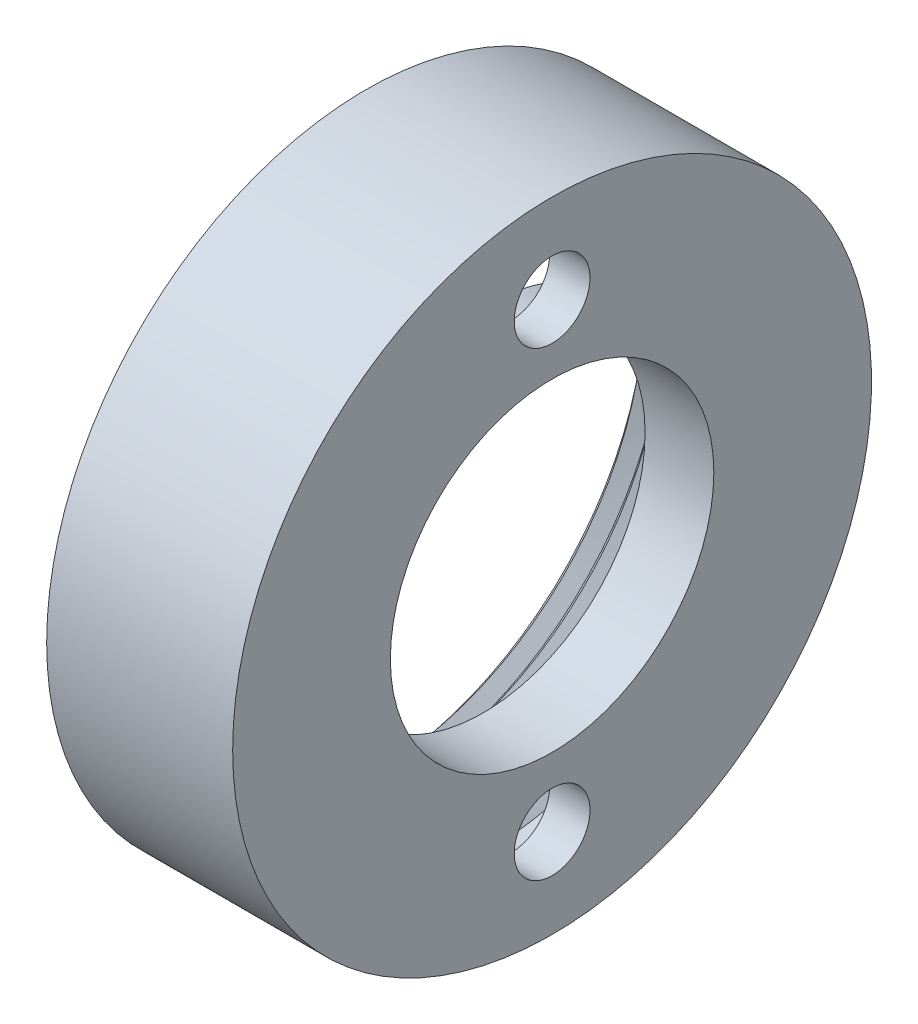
ISO-10303-21;
HEADER;
FILE_DESCRIPTION(('STEP AP214'),'2;1');
FILE_NAME('part.step','',(''),(''),'','','');
FILE_SCHEMA(('AUTOMOTIVE_DESIGN { 1 0 10303 214 1 1 1 1 }'));
ENDSEC;
DATA;
#1=APPLICATION_CONTEXT('core data for automotive mechanical design processes');
#2=APPLICATION_PROTOCOL_DEFINITION('international standard','automotive_design',2000,#1);
#3=PRODUCT_CONTEXT('',#1,'mechanical');
#4=PRODUCT('Part','Part','',(#3));
#5=PRODUCT_RELATED_PRODUCT_CATEGORY('part','',(#4));
#6=PRODUCT_DEFINITION_FORMATION('','',#4);
#7=PRODUCT_DEFINITION_CONTEXT('part definition',#1,'design');
#8=PRODUCT_DEFINITION('design','',#6,#7);
#9=PRODUCT_DEFINITION_SHAPE('','',#8);
#10=(LENGTH_UNIT() NAMED_UNIT(*) SI_UNIT(.MILLI.,.METRE.));
#11=(NAMED_UNIT(*) PLANE_ANGLE_UNIT() SI_UNIT($,.RADIAN.));
#12=(NAMED_UNIT(*) SI_UNIT($,.STERADIAN.) SOLID_ANGLE_UNIT());
#13=UNCERTAINTY_MEASURE_WITH_UNIT(LENGTH_MEASURE(1.E-05),#10,'distance_accuracy_value','');
#14=(GEOMETRIC_REPRESENTATION_CONTEXT(3) GLOBAL_UNCERTAINTY_ASSIGNED_CONTEXT((#13)) GLOBAL_UNIT_ASSIGNED_CONTEXT((#10,
#11,#12)) REPRESENTATION_CONTEXT('',''));
#15=CARTESIAN_POINT('',(0.,0.,0.));
#16=DIRECTION('',(0.,0.,1.));
#17=DIRECTION('',(1.,0.,0.));
#18=AXIS2_PLACEMENT_3D('',#15,#16,#17);
#19=CARTESIAN_POINT('',(0.,0.,0.));
#20=DIRECTION('',(-1.,0.,0.));
#21=DIRECTION('',(0.,0.,1.));
#22=AXIS2_PLACEMENT_3D('',#19,#20,#21);
#23=CYLINDRICAL_SURFACE('',#22,20.066);
#24=CARTESIAN_POINT('',(0.,0.,0.));
#25=DIRECTION('',(-1.,0.,0.));
#26=DIRECTION('',(0.,0.,1.));
#27=AXIS2_PLACEMENT_3D('',#24,#25,#26);
#28=CIRCLE('',#27,20.066);
#29=CARTESIAN_POINT('',(0.,0.,20.066));
#30=VERTEX_POINT('',#29);
#31=EDGE_CURVE('E11',#30,#30,#28,.T.);
#32=ORIENTED_EDGE('',*,*,#31,.F.);
#33=EDGE_LOOP('',(#32));
#34=FACE_BOUND('',#33,.T.);
#35=CARTESIAN_POINT('',(11.684,0.,0.));
#36=DIRECTION('',(-1.,0.,0.));
#37=DIRECTION('',(0.,0.,1.));
#38=AXIS2_PLACEMENT_3D('',#35,#36,#37);
#39=CIRCLE('',#38,20.066);
#40=CARTESIAN_POINT('',(11.684,0.,20.066));
#41=VERTEX_POINT('',#40);
#42=EDGE_CURVE('E192',#41,#41,#39,.T.);
#43=ORIENTED_EDGE('',*,*,#42,.T.);
#44=EDGE_LOOP('',(#43));
#45=FACE_BOUND('',#44,.T.);
#46=ADVANCED_FACE('F30',(#34,#45),#23,.T.);
#47=CARTESIAN_POINT('',(0.,17.526,0.));
#48=DIRECTION('',(1.,0.,0.));
#49=DIRECTION('',(0.,0.,-1.));
#50=AXIS2_PLACEMENT_3D('',#47,#48,#49);
#51=PLANE('',#50);
#52=CARTESIAN_POINT('',(0.,0.,0.));
#53=DIRECTION('',(-1.,0.,0.));
#54=DIRECTION('',(0.,0.,1.));
#55=AXIS2_PLACEMENT_3D('',#52,#53,#54);
#56=CIRCLE('',#55,17.526);
#57=CARTESIAN_POINT('',(0.,0.,17.526));
#58=VERTEX_POINT('',#57);
#59=EDGE_CURVE('E37',#58,#58,#56,.T.);
#60=ORIENTED_EDGE('',*,*,#59,.F.);
#61=EDGE_LOOP('',(#60));
#62=FACE_BOUND('',#61,.T.);
#63=ORIENTED_EDGE('',*,*,#31,.T.);
#64=EDGE_LOOP('',(#63));
#65=FACE_BOUND('',#64,.T.);
#66=ADVANCED_FACE('F183',(#62,#65),#51,.F.);
#67=CARTESIAN_POINT('',(0.,0.,0.));
#68=DIRECTION('',(-1.,0.,0.));
#69=DIRECTION('',(0.,0.,1.));
#70=AXIS2_PLACEMENT_3D('',#67,#68,#69);
#71=CONICAL_SURFACE('',#70,17.526,0.876058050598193);
#72=CARTESIAN_POINT('',(0.634999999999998,0.,0.));
#73=DIRECTION('',(-1.,0.,0.));
#74=DIRECTION('',(0.,0.,1.));
#75=AXIS2_PLACEMENT_3D('',#72,#73,#74);
#76=CIRCLE('',#75,16.764);
#77=CARTESIAN_POINT('',(0.634999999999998,-16.7486472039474,0.717295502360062));
#78=VERTEX_POINT('',#77);
#79=CARTESIAN_POINT('',(0.634999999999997,16.7486472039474,0.71729550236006));
#80=VERTEX_POINT('',#79);
#81=EDGE_CURVE('E175',#78,#80,#76,.T.);
#82=ORIENTED_EDGE('',*,*,#81,.F.);
#83=CARTESIAN_POINT('',(1.04042167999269,-16.193498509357,1.65148915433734));
#84=CARTESIAN_POINT('',(1.01051744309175,-16.2338431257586,1.60958601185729));
#85=CARTESIAN_POINT('',(0.981586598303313,-16.2730092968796,1.56582309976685));
#86=CARTESIAN_POINT('',(0.925878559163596,-16.3486483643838,1.4746308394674));
#87=CARTESIAN_POINT('',(0.899104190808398,-16.3851177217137,1.42719683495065));
#88=CARTESIAN_POINT('',(0.848058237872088,-16.4548334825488,1.32894708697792));
#89=CARTESIAN_POINT('',(0.82378056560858,-16.4880877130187,1.2781400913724));
#90=CARTESIAN_POINT('',(0.777924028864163,-16.5510477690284,1.17326988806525));
#91=CARTESIAN_POINT('',(0.756343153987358,-16.580756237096,1.11920915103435));
#92=CARTESIAN_POINT('',(0.71637759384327,-16.6358848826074,1.00878150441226));
#93=CARTESIAN_POINT('',(0.697954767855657,-16.6613561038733,0.952454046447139));
#94=CARTESIAN_POINT('',(0.66420249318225,-16.7080993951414,0.837187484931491));
#95=CARTESIAN_POINT('',(0.648873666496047,-16.7293706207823,0.778247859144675));
#96=CARTESIAN_POINT('',(0.611733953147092,-16.7809738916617,0.615079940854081));
#97=CARTESIAN_POINT('',(0.593142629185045,-16.8068854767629,0.508646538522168));
#98=CARTESIAN_POINT('',(0.566632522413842,-16.8438655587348,0.291802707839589));
#99=CARTESIAN_POINT('',(0.558727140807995,-16.8549154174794,0.181387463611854));
#100=CARTESIAN_POINT('',(0.554019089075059,-16.8614938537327,-0.0402851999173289));
#101=CARTESIAN_POINT('',(0.557231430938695,-16.8570014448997,-0.151543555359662));
#102=CARTESIAN_POINT('',(0.574628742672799,-16.8327091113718,-0.371324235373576));
#103=CARTESIAN_POINT('',(0.588790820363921,-16.8129411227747,-0.479851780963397));
#104=CARTESIAN_POINT('',(0.612112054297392,-16.7804746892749,-0.607864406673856));
#105=CARTESIAN_POINT('',(0.616417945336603,-16.7744826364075,-0.630117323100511));
#106=CARTESIAN_POINT('',(0.625475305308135,-16.761885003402,-0.674351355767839));
#107=CARTESIAN_POINT('',(0.630226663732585,-16.7552795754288,-0.696332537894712));
#108=CARTESIAN_POINT('',(0.6630928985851,-16.7096131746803,-0.840675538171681));
#109=CARTESIAN_POINT('',(0.697968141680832,-16.6612683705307,-0.958800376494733));
#110=CARTESIAN_POINT('',(0.779716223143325,-16.5485265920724,-1.18284276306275));
#111=CARTESIAN_POINT('',(0.826632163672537,-16.4840719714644,-1.28871443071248));
#112=CARTESIAN_POINT('',(0.92990393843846,-16.3430793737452,-1.48537902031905));
#113=CARTESIAN_POINT('',(0.986184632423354,-16.2666378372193,-1.57628133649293));
#114=CARTESIAN_POINT('',(1.10643412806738,-16.1044758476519,-1.7431169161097));
#115=CARTESIAN_POINT('',(1.17039336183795,-16.0187669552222,-1.81906850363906));
#116=CARTESIAN_POINT('',(1.28276638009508,-15.8693555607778,-1.93398016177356));
#117=CARTESIAN_POINT('',(1.32953198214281,-15.8074824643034,-1.97696615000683));
#118=CARTESIAN_POINT('',(1.37743618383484,-15.7444637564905,-2.01653691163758));
#119=B_SPLINE_CURVE_WITH_KNOTS('',3,(#83,#84,#85,#86,#87,#88,#89,#90,#91,#92,#93,#94,#95,#96,
#97,#98,#99,#100,#101,#102,#103,#104,#105,#106,#107,#108,#109,#110,#111,#112,#113,#114,#115,
#116,#117,#118),.UNSPECIFIED.,.F.,.F.,(4,2,2,2,2,2,2,2,2,2,2,2,2,2,2,2,2,4),(0.,
0.196200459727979,0.392653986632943,0.588616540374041,0.784432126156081,0.977684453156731,
1.17097559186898,1.50269195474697,1.83482393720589,2.16740456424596,2.49929175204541,
2.56961906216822,2.63992897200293,3.03426128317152,3.43002537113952,3.82275487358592,
4.21499999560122,4.48060232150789),.UNSPECIFIED.);
#120=CARTESIAN_POINT('',(0.635,-16.7486472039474,-0.71729550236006));
#121=VERTEX_POINT('',#120);
#122=EDGE_CURVE('E43',#78,#121,#119,.T.);
#123=ORIENTED_EDGE('',*,*,#122,.T.);
#124=CARTESIAN_POINT('',(0.634999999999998,16.7486472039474,-0.717295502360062));
#125=VERTEX_POINT('',#124);
#126=EDGE_CURVE('E176',#125,#121,#76,.T.);
#127=ORIENTED_EDGE('',*,*,#126,.F.);
#128=CARTESIAN_POINT('',(1.37743618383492,15.7444637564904,-2.01653691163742));
#129=CARTESIAN_POINT('',(1.33398257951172,15.8016316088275,-1.98061921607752));
#130=CARTESIAN_POINT('',(1.29151379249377,15.8577879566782,-1.94196939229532));
#131=CARTESIAN_POINT('',(1.20878332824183,15.9676778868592,-1.8590268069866));
#132=CARTESIAN_POINT('',(1.16852518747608,16.0214075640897,-1.81472536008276));
#133=CARTESIAN_POINT('',(1.05109886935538,16.1787943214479,-1.67262051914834));
#134=CARTESIAN_POINT('',(0.977872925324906,16.2778651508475,-1.56609702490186));
#135=CARTESIAN_POINT('',(0.861820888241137,16.4359186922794,-1.35994811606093));
#136=CARTESIAN_POINT('',(0.815936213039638,16.4987855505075,-1.26497648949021));
#137=CARTESIAN_POINT('',(0.734116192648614,16.6113335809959,-1.06412238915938));
#138=CARTESIAN_POINT('',(0.698128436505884,16.6610841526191,-0.958301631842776));
#139=CARTESIAN_POINT('',(0.656087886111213,16.7193615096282,-0.805454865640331));
#140=CARTESIAN_POINT('',(0.645202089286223,16.7344720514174,-0.762122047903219));
#141=CARTESIAN_POINT('',(0.611751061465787,16.7809501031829,-0.615144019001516));
#142=CARTESIAN_POINT('',(0.593159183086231,16.8068624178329,-0.508735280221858));
#143=CARTESIAN_POINT('',(0.56663652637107,16.8438599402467,-0.291882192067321));
#144=CARTESIAN_POINT('',(0.558727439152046,16.8549149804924,-0.18143009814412));
#145=CARTESIAN_POINT('',(0.554019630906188,16.8614931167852,0.0402883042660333));
#146=CARTESIAN_POINT('',(0.557231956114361,16.8570007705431,0.151555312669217));
#147=CARTESIAN_POINT('',(0.574629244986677,16.8327083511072,0.371325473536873));
#148=CARTESIAN_POINT('',(0.58879067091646,16.8129411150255,0.47983403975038));
#149=CARTESIAN_POINT('',(0.616187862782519,16.7748006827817,0.630244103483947));
#150=CARTESIAN_POINT('',(0.625253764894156,16.7621892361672,0.674493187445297));
#151=CARTESIAN_POINT('',(0.651480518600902,16.7257481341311,0.789674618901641));
#152=CARTESIAN_POINT('',(0.670119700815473,16.6998890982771,0.859653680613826));
#153=CARTESIAN_POINT('',(0.711763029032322,16.6422584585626,0.995909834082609));
#154=CARTESIAN_POINT('',(0.734776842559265,16.6104737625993,1.06217829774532));
#155=CARTESIAN_POINT('',(0.798266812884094,16.5230444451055,1.22501860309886));
#156=CARTESIAN_POINT('',(0.841463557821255,16.4637814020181,1.31864016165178));
#157=CARTESIAN_POINT('',(0.91203019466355,16.3675101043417,1.45019564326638));
#158=CARTESIAN_POINT('',(0.93649915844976,16.3342107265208,1.49254696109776));
#159=CARTESIAN_POINT('',(0.98718519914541,16.2654314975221,1.57425554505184));
#160=CARTESIAN_POINT('',(1.01340067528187,16.2299536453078,1.61361548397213));
#161=CARTESIAN_POINT('',(1.04042167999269,16.193498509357,1.65148915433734));
#162=B_SPLINE_CURVE_WITH_KNOTS('',3,(#128,#129,#130,#131,#132,#133,#134,#135,#136,#137,#138,
#139,#140,#141,#142,#143,#144,#145,#146,#147,#148,#149,#150,#151,#152,#153,#154,#155,#156,#157,
#158,#159,#160,#161),.UNSPECIFIED.,.F.,.F.,(4,2,2,2,2,2,2,2,2,2,2,2,2,2,2,2,4),(0.,
0.240731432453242,0.481837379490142,0.967293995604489,1.33435373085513,1.69943046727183,
1.84086855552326,2.17245658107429,2.50471688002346,2.83730728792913,3.16918469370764,
3.30980104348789,3.53996925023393,3.77065214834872,4.12584913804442,4.30325095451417,
4.48049235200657),.UNSPECIFIED.);
#163=EDGE_CURVE('E195',#125,#80,#162,.T.);
#164=ORIENTED_EDGE('',*,*,#163,.T.);
#165=EDGE_LOOP('',(#82,#123,#127,#164));
#166=FACE_BOUND('',#165,.T.);
#167=ORIENTED_EDGE('',*,*,#59,.T.);
#168=EDGE_LOOP('',(#167));
#169=FACE_BOUND('',#168,.T.);
#170=ADVANCED_FACE('F181',(#166,#169),#71,.F.);
#171=CARTESIAN_POINT('',(0.634999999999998,0.,0.));
#172=DIRECTION('',(1.,0.,0.));
#173=DIRECTION('',(0.,0.,-1.));
#174=AXIS2_PLACEMENT_3D('',#171,#172,#173);
#175=CONICAL_SURFACE('',#174,16.764,0.876058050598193);
#176=CARTESIAN_POINT('',(1.27,0.,0.));
#177=DIRECTION('',(-1.,0.,0.));
#178=DIRECTION('',(0.,0.,1.));
#179=AXIS2_PLACEMENT_3D('',#176,#177,#178);
#180=CIRCLE('',#179,17.526);
#181=CARTESIAN_POINT('',(1.27,0.,17.526));
#182=VERTEX_POINT('',#181);
#183=EDGE_CURVE('E172',#182,#182,#180,.T.);
#184=ORIENTED_EDGE('',*,*,#183,.F.);
#185=EDGE_LOOP('',(#184));
#186=FACE_BOUND('',#185,.T.);
#187=ORIENTED_EDGE('',*,*,#126,.T.);
#188=CARTESIAN_POINT('',(-0.107436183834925,-15.7444637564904,-2.01653691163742));
#189=CARTESIAN_POINT('',(-0.0639825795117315,-15.8016316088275,-1.98061921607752));
#190=CARTESIAN_POINT('',(-0.0215137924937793,-15.8577879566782,-1.94196939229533));
#191=CARTESIAN_POINT('',(0.0612166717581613,-15.9676778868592,-1.8590268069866));
#192=CARTESIAN_POINT('',(0.101474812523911,-16.0214075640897,-1.81472536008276));
#193=CARTESIAN_POINT('',(0.218901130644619,-16.1787943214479,-1.67262051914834));
#194=CARTESIAN_POINT('',(0.29212707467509,-16.2778651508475,-1.56609702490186));
#195=CARTESIAN_POINT('',(0.408179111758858,-16.4359186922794,-1.35994811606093));
#196=CARTESIAN_POINT('',(0.454063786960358,-16.4987855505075,-1.26497648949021));
#197=CARTESIAN_POINT('',(0.535883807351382,-16.6113335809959,-1.06412238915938));
#198=CARTESIAN_POINT('',(0.571871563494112,-16.6610841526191,-0.958301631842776));
#199=CARTESIAN_POINT('',(0.613912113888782,-16.7193615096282,-0.805454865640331));
#200=CARTESIAN_POINT('',(0.624797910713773,-16.7344720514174,-0.762122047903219));
#201=CARTESIAN_POINT('',(0.658248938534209,-16.7809501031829,-0.615144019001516));
#202=CARTESIAN_POINT('',(0.676840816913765,-16.8068624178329,-0.508735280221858));
#203=CARTESIAN_POINT('',(0.703363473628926,-16.8438599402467,-0.291882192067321));
#204=CARTESIAN_POINT('',(0.71127256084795,-16.8549149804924,-0.18143009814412));
#205=CARTESIAN_POINT('',(0.715980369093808,-16.8614931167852,0.0402883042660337));
#206=CARTESIAN_POINT('',(0.712768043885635,-16.8570007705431,0.151555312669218));
#207=CARTESIAN_POINT('',(0.695370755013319,-16.8327083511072,0.371325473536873));
#208=CARTESIAN_POINT('',(0.681209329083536,-16.8129411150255,0.479834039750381));
#209=CARTESIAN_POINT('',(0.653812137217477,-16.7748006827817,0.630244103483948));
#210=CARTESIAN_POINT('',(0.64474623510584,-16.7621892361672,0.674493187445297));
#211=CARTESIAN_POINT('',(0.618519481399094,-16.7257481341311,0.78967461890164));
#212=CARTESIAN_POINT('',(0.599880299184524,-16.6998890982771,0.859653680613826));
#213=CARTESIAN_POINT('',(0.558236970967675,-16.6422584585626,0.995909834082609));
#214=CARTESIAN_POINT('',(0.535223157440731,-16.6104737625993,1.06217829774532));
#215=CARTESIAN_POINT('',(0.471733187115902,-16.5230444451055,1.22501860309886));
#216=CARTESIAN_POINT('',(0.428536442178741,-16.4637814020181,1.31864016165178));
#217=CARTESIAN_POINT('',(0.357969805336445,-16.3675101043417,1.45019564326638));
#218=CARTESIAN_POINT('',(0.333500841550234,-16.3342107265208,1.49254696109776));
#219=CARTESIAN_POINT('',(0.282814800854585,-16.2654314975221,1.57425554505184));
#220=CARTESIAN_POINT('',(0.256599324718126,-16.2299536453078,1.61361548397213));
#221=CARTESIAN_POINT('',(0.229578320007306,-16.193498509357,1.65148915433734));
#222=B_SPLINE_CURVE_WITH_KNOTS('',3,(#188,#189,#190,#191,#192,#193,#194,#195,#196,#197,#198,
#199,#200,#201,#202,#203,#204,#205,#206,#207,#208,#209,#210,#211,#212,#213,#214,#215,#216,#217,
#218,#219,#220,#221),.UNSPECIFIED.,.F.,.F.,(4,2,2,2,2,2,2,2,2,2,2,2,2,2,2,2,4),(0.,
0.240731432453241,0.481837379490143,0.967293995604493,1.33435373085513,1.69943046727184,
1.84086855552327,2.17245658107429,2.50471688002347,2.83730728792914,3.16918469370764,
3.3098010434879,3.53996925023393,3.77065214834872,4.12584913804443,4.30325095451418,
4.48049235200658),.UNSPECIFIED.);
#223=EDGE_CURVE('E323',#121,#78,#222,.T.);
#224=ORIENTED_EDGE('',*,*,#223,.T.);
#225=ORIENTED_EDGE('',*,*,#81,.T.);
#226=CARTESIAN_POINT('',(0.229578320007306,16.193498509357,1.65148915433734));
#227=CARTESIAN_POINT('',(0.259482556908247,16.2338431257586,1.60958601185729));
#228=CARTESIAN_POINT('',(0.288413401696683,16.2730092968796,1.56582309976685));
#229=CARTESIAN_POINT('',(0.344121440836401,16.3486483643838,1.4746308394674));
#230=CARTESIAN_POINT('',(0.370895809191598,16.3851177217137,1.42719683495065));
#231=CARTESIAN_POINT('',(0.421941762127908,16.4548334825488,1.32894708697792));
#232=CARTESIAN_POINT('',(0.446219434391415,16.4880877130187,1.27814009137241));
#233=CARTESIAN_POINT('',(0.492075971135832,16.5510477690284,1.17326988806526));
#234=CARTESIAN_POINT('',(0.513656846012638,16.580756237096,1.11920915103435));
#235=CARTESIAN_POINT('',(0.553622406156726,16.6358848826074,1.00878150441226));
#236=CARTESIAN_POINT('',(0.572045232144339,16.6613561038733,0.952454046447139));
#237=CARTESIAN_POINT('',(0.605797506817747,16.7080993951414,0.837187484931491));
#238=CARTESIAN_POINT('',(0.621126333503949,16.7293706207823,0.778247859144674));
#239=CARTESIAN_POINT('',(0.658266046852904,16.7809738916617,0.61507994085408));
#240=CARTESIAN_POINT('',(0.67685737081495,16.8068854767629,0.508646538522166));
#241=CARTESIAN_POINT('',(0.703367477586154,16.8438655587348,0.291802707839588));
#242=CARTESIAN_POINT('',(0.711272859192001,16.8549154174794,0.181387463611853));
#243=CARTESIAN_POINT('',(0.715980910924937,16.8614938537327,-0.0402851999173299));
#244=CARTESIAN_POINT('',(0.712768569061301,16.8570014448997,-0.151543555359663));
#245=CARTESIAN_POINT('',(0.695371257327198,16.8327091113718,-0.371324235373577));
#246=CARTESIAN_POINT('',(0.681209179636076,16.8129411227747,-0.479851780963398));
#247=CARTESIAN_POINT('',(0.657887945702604,16.7804746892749,-0.607864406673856));
#248=CARTESIAN_POINT('',(0.653582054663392,16.7744826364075,-0.630117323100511));
#249=CARTESIAN_POINT('',(0.644524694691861,16.761885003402,-0.674351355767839));
#250=CARTESIAN_POINT('',(0.639773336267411,16.7552795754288,-0.696332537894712));
#251=CARTESIAN_POINT('',(0.606907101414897,16.7096131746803,-0.840675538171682));
#252=CARTESIAN_POINT('',(0.572031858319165,16.6612683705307,-0.958800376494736));
#253=CARTESIAN_POINT('',(0.490283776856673,16.5485265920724,-1.18284276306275));
#254=CARTESIAN_POINT('',(0.443367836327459,16.4840719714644,-1.28871443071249));
#255=CARTESIAN_POINT('',(0.340096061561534,16.3430793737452,-1.48537902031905));
#256=CARTESIAN_POINT('',(0.28381536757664,16.2666378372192,-1.57628133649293));
#257=CARTESIAN_POINT('',(0.163565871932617,16.1044758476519,-1.7431169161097));
#258=CARTESIAN_POINT('',(0.0996066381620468,16.0187669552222,-1.81906850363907));
#259=CARTESIAN_POINT('',(-0.0127663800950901,15.8693555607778,-1.93398016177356));
#260=CARTESIAN_POINT('',(-0.0595319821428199,15.8074824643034,-1.97696615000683));
#261=CARTESIAN_POINT('',(-0.107436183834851,15.7444637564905,-2.01653691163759));
#262=B_SPLINE_CURVE_WITH_KNOTS('',3,(#226,#227,#228,#229,#230,#231,#232,#233,#234,#235,#236,
#237,#238,#239,#240,#241,#242,#243,#244,#245,#246,#247,#248,#249,#250,#251,#252,#253,#254,#255,
#256,#257,#258,#259,#260,#261),.UNSPECIFIED.,.F.,.F.,(4,2,2,2,2,2,2,2,2,2,2,2,2,2,2,2,2,4),(0.,
0.19620045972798,0.392653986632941,0.58861654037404,0.784432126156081,0.977684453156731,
1.17097559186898,1.50269195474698,1.83482393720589,2.16740456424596,2.49929175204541,
2.56961906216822,2.63992897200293,3.03426128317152,3.43002537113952,3.82275487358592,
4.21499999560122,4.4806023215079),.UNSPECIFIED.);
#263=EDGE_CURVE('E201',#80,#125,#262,.T.);
#264=ORIENTED_EDGE('',*,*,#263,.T.);
#265=EDGE_LOOP('',(#187,#224,#225,#264));
#266=FACE_BOUND('',#265,.T.);
#267=ADVANCED_FACE('F332',(#186,#266),#175,.F.);
#268=CARTESIAN_POINT('',(1.27,0.,0.));
#269=DIRECTION('',(-1.,0.,0.));
#270=DIRECTION('',(0.,0.,1.));
#271=AXIS2_PLACEMENT_3D('',#268,#269,#270);
#272=CONICAL_SURFACE('',#271,17.526,0.876058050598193);
#273=CARTESIAN_POINT('',(1.905,0.,0.));
#274=DIRECTION('',(-1.,0.,0.));
#275=DIRECTION('',(0.,0.,1.));
#276=AXIS2_PLACEMENT_3D('',#273,#274,#275);
#277=CIRCLE('',#276,16.764);
#278=CARTESIAN_POINT('',(1.905,-16.7486472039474,0.717295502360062));
#279=VERTEX_POINT('',#278);
#280=CARTESIAN_POINT('',(1.905,16.7486472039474,0.71729550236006));
#281=VERTEX_POINT('',#280);
#282=EDGE_CURVE('E168',#279,#281,#277,.T.);
#283=ORIENTED_EDGE('',*,*,#282,.F.);
#284=CARTESIAN_POINT('',(2.31042167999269,-16.193498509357,1.65148915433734));
#285=CARTESIAN_POINT('',(2.28051744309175,-16.2338431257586,1.60958601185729));
#286=CARTESIAN_POINT('',(2.25158659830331,-16.2730092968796,1.56582309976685));
#287=CARTESIAN_POINT('',(2.1958785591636,-16.3486483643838,1.4746308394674));
#288=CARTESIAN_POINT('',(2.1691041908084,-16.3851177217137,1.42719683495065));
#289=CARTESIAN_POINT('',(2.11805823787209,-16.4548334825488,1.32894708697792));
#290=CARTESIAN_POINT('',(2.09378056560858,-16.4880877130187,1.2781400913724));
#291=CARTESIAN_POINT('',(2.04792402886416,-16.5510477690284,1.17326988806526));
#292=CARTESIAN_POINT('',(2.02634315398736,-16.580756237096,1.11920915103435));
#293=CARTESIAN_POINT('',(1.98637759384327,-16.6358848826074,1.00878150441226));
#294=CARTESIAN_POINT('',(1.96795476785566,-16.6613561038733,0.952454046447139));
#295=CARTESIAN_POINT('',(1.93420249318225,-16.7080993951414,0.837187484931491));
#296=CARTESIAN_POINT('',(1.91887366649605,-16.7293706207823,0.778247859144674));
#297=CARTESIAN_POINT('',(1.88173395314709,-16.7809738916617,0.61507994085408));
#298=CARTESIAN_POINT('',(1.86314262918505,-16.8068854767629,0.508646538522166));
#299=CARTESIAN_POINT('',(1.83663252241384,-16.8438655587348,0.291802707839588));
#300=CARTESIAN_POINT('',(1.82872714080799,-16.8549154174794,0.181387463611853));
#301=CARTESIAN_POINT('',(1.82401908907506,-16.8614938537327,-0.0402851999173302));
#302=CARTESIAN_POINT('',(1.82723143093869,-16.8570014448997,-0.151543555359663));
#303=CARTESIAN_POINT('',(1.8446287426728,-16.8327091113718,-0.371324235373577));
#304=CARTESIAN_POINT('',(1.85879082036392,-16.8129411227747,-0.479851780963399));
#305=CARTESIAN_POINT('',(1.88211205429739,-16.7804746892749,-0.607864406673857));
#306=CARTESIAN_POINT('',(1.8864179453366,-16.7744826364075,-0.630117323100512));
#307=CARTESIAN_POINT('',(1.89547530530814,-16.761885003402,-0.674351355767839));
#308=CARTESIAN_POINT('',(1.90022666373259,-16.7552795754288,-0.696332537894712));
#309=CARTESIAN_POINT('',(1.9330928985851,-16.7096131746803,-0.840675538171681));
#310=CARTESIAN_POINT('',(1.96796814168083,-16.6612683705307,-0.958800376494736));
#311=CARTESIAN_POINT('',(2.04971622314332,-16.5485265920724,-1.18284276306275));
#312=CARTESIAN_POINT('',(2.09663216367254,-16.4840719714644,-1.28871443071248));
#313=CARTESIAN_POINT('',(2.19990393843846,-16.3430793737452,-1.48537902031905));
#314=CARTESIAN_POINT('',(2.25618463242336,-16.2666378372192,-1.57628133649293));
#315=CARTESIAN_POINT('',(2.37643412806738,-16.1044758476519,-1.7431169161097));
#316=CARTESIAN_POINT('',(2.44039336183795,-16.0187669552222,-1.81906850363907));
#317=CARTESIAN_POINT('',(2.55276638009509,-15.8693555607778,-1.93398016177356));
#318=CARTESIAN_POINT('',(2.59953198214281,-15.8074824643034,-1.97696615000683));
#319=CARTESIAN_POINT('',(2.64743618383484,-15.7444637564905,-2.01653691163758));
#320=B_SPLINE_CURVE_WITH_KNOTS('',3,(#284,#285,#286,#287,#288,#289,#290,#291,#292,#293,#294,
#295,#296,#297,#298,#299,#300,#301,#302,#303,#304,#305,#306,#307,#308,#309,#310,#311,#312,#313,
#314,#315,#316,#317,#318,#319),.UNSPECIFIED.,.F.,.F.,(4,2,2,2,2,2,2,2,2,2,2,2,2,2,2,2,2,4),(0.,
0.196200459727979,0.392653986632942,0.588616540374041,0.784432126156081,0.977684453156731,
1.17097559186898,1.50269195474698,1.83482393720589,2.16740456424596,2.49929175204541,
2.56961906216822,2.63992897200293,3.03426128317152,3.43002537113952,3.82275487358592,
4.21499999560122,4.48060232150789),.UNSPECIFIED.);
#321=CARTESIAN_POINT('',(1.905,-16.7486472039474,-0.71729550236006));
#322=VERTEX_POINT('',#321);
#323=EDGE_CURVE('E50',#279,#322,#320,.T.);
#324=ORIENTED_EDGE('',*,*,#323,.T.);
#325=CARTESIAN_POINT('',(1.905,16.7486472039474,-0.717295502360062));
#326=VERTEX_POINT('',#325);
#327=EDGE_CURVE('E169',#326,#322,#277,.T.);
#328=ORIENTED_EDGE('',*,*,#327,.F.);
#329=CARTESIAN_POINT('',(2.64743618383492,15.7444637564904,-2.01653691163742));
#330=CARTESIAN_POINT('',(2.60398257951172,15.8016316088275,-1.98061921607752));
#331=CARTESIAN_POINT('',(2.56151379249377,15.8577879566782,-1.94196939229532));
#332=CARTESIAN_POINT('',(2.47878332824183,15.9676778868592,-1.8590268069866));
#333=CARTESIAN_POINT('',(2.43852518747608,16.0214075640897,-1.81472536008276));
#334=CARTESIAN_POINT('',(2.32109886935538,16.1787943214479,-1.67262051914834));
#335=CARTESIAN_POINT('',(2.24787292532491,16.2778651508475,-1.56609702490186));
#336=CARTESIAN_POINT('',(2.13182088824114,16.4359186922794,-1.35994811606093));
#337=CARTESIAN_POINT('',(2.08593621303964,16.4987855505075,-1.26497648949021));
#338=CARTESIAN_POINT('',(2.00411619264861,16.6113335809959,-1.06412238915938));
#339=CARTESIAN_POINT('',(1.96812843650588,16.6610841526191,-0.958301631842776));
#340=CARTESIAN_POINT('',(1.92608788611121,16.7193615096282,-0.80545486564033));
#341=CARTESIAN_POINT('',(1.91520208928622,16.7344720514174,-0.762122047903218));
#342=CARTESIAN_POINT('',(1.88175106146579,16.7809501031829,-0.615144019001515));
#343=CARTESIAN_POINT('',(1.86315918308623,16.8068624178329,-0.508735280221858));
#344=CARTESIAN_POINT('',(1.83663652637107,16.8438599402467,-0.291882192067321));
#345=CARTESIAN_POINT('',(1.82872743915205,16.8549149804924,-0.18143009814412));
#346=CARTESIAN_POINT('',(1.82401963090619,16.8614931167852,0.0402883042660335));
#347=CARTESIAN_POINT('',(1.82723195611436,16.8570007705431,0.151555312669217));
#348=CARTESIAN_POINT('',(1.84462924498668,16.8327083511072,0.371325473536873));
#349=CARTESIAN_POINT('',(1.85879067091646,16.8129411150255,0.479834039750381));
#350=CARTESIAN_POINT('',(1.88618786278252,16.7748006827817,0.630244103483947));
#351=CARTESIAN_POINT('',(1.89525376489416,16.7621892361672,0.674493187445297));
#352=CARTESIAN_POINT('',(1.9214805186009,16.7257481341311,0.78967461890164));
#353=CARTESIAN_POINT('',(1.94011970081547,16.6998890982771,0.859653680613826));
#354=CARTESIAN_POINT('',(1.98176302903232,16.6422584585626,0.995909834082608));
#355=CARTESIAN_POINT('',(2.00477684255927,16.6104737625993,1.06217829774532));
#356=CARTESIAN_POINT('',(2.06826681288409,16.5230444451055,1.22501860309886));
#357=CARTESIAN_POINT('',(2.11146355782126,16.4637814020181,1.31864016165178));
#358=CARTESIAN_POINT('',(2.18203019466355,16.3675101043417,1.45019564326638));
#359=CARTESIAN_POINT('',(2.20649915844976,16.3342107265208,1.49254696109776));
#360=CARTESIAN_POINT('',(2.25718519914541,16.2654314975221,1.57425554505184));
#361=CARTESIAN_POINT('',(2.28340067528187,16.2299536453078,1.61361548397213));
#362=CARTESIAN_POINT('',(2.31042167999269,16.193498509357,1.65148915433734));
#363=B_SPLINE_CURVE_WITH_KNOTS('',3,(#329,#330,#331,#332,#333,#334,#335,#336,#337,#338,#339,
#340,#341,#342,#343,#344,#345,#346,#347,#348,#349,#350,#351,#352,#353,#354,#355,#356,#357,#358,
#359,#360,#361,#362),.UNSPECIFIED.,.F.,.F.,(4,2,2,2,2,2,2,2,2,2,2,2,2,2,2,2,4),(0.,
0.240731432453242,0.481837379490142,0.967293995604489,1.33435373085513,1.69943046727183,
1.84086855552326,2.17245658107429,2.50471688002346,2.83730728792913,3.16918469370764,
3.30980104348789,3.53996925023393,3.77065214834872,4.12584913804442,4.30325095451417,
4.48049235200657),.UNSPECIFIED.);
#364=EDGE_CURVE('E345',#326,#281,#363,.T.);
#365=ORIENTED_EDGE('',*,*,#364,.T.);
#366=EDGE_LOOP('',(#283,#324,#328,#365));
#367=FACE_BOUND('',#366,.T.);
#368=ORIENTED_EDGE('',*,*,#183,.T.);
#369=EDGE_LOOP('',(#368));
#370=FACE_BOUND('',#369,.T.);
#371=ADVANCED_FACE('F335',(#367,#370),#272,.F.);
#372=CARTESIAN_POINT('',(1.905,0.,0.));
#373=DIRECTION('',(1.,0.,0.));
#374=DIRECTION('',(0.,0.,-1.));
#375=AXIS2_PLACEMENT_3D('',#372,#373,#374);
#376=CONICAL_SURFACE('',#375,16.764,0.876058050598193);
#377=CARTESIAN_POINT('',(2.54,0.,0.));
#378=DIRECTION('',(-1.,0.,0.));
#379=DIRECTION('',(0.,0.,1.));
#380=AXIS2_PLACEMENT_3D('',#377,#378,#379);
#381=CIRCLE('',#380,17.526);
#382=CARTESIAN_POINT('',(2.54,0.,17.526));
#383=VERTEX_POINT('',#382);
#384=EDGE_CURVE('E165',#383,#383,#381,.T.);
#385=ORIENTED_EDGE('',*,*,#384,.F.);
#386=EDGE_LOOP('',(#385));
#387=FACE_BOUND('',#386,.T.);
#388=ORIENTED_EDGE('',*,*,#327,.T.);
#389=CARTESIAN_POINT('',(1.16256381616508,-15.7444637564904,-2.01653691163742));
#390=CARTESIAN_POINT('',(1.20601742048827,-15.8016316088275,-1.98061921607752));
#391=CARTESIAN_POINT('',(1.24848620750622,-15.8577879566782,-1.94196939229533));
#392=CARTESIAN_POINT('',(1.33121667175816,-15.9676778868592,-1.8590268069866));
#393=CARTESIAN_POINT('',(1.37147481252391,-16.0214075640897,-1.81472536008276));
#394=CARTESIAN_POINT('',(1.48890113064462,-16.1787943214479,-1.67262051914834));
#395=CARTESIAN_POINT('',(1.56212707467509,-16.2778651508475,-1.56609702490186));
#396=CARTESIAN_POINT('',(1.67817911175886,-16.4359186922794,-1.35994811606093));
#397=CARTESIAN_POINT('',(1.72406378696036,-16.4987855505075,-1.26497648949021));
#398=CARTESIAN_POINT('',(1.80588380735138,-16.6113335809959,-1.06412238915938));
#399=CARTESIAN_POINT('',(1.84187156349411,-16.6610841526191,-0.958301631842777));
#400=CARTESIAN_POINT('',(1.88391211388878,-16.7193615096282,-0.805454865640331));
#401=CARTESIAN_POINT('',(1.89479791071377,-16.7344720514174,-0.762122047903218));
#402=CARTESIAN_POINT('',(1.92824893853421,-16.7809501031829,-0.615144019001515));
#403=CARTESIAN_POINT('',(1.94684081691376,-16.8068624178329,-0.508735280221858));
#404=CARTESIAN_POINT('',(1.97336347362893,-16.8438599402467,-0.29188219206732));
#405=CARTESIAN_POINT('',(1.98127256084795,-16.8549149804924,-0.18143009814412));
#406=CARTESIAN_POINT('',(1.98598036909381,-16.8614931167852,0.0402883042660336));
#407=CARTESIAN_POINT('',(1.98276804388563,-16.8570007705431,0.151555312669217));
#408=CARTESIAN_POINT('',(1.96537075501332,-16.8327083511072,0.371325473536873));
#409=CARTESIAN_POINT('',(1.95120932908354,-16.8129411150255,0.479834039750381));
#410=CARTESIAN_POINT('',(1.92381213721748,-16.7748006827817,0.630244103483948));
#411=CARTESIAN_POINT('',(1.91474623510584,-16.7621892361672,0.674493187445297));
#412=CARTESIAN_POINT('',(1.88851948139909,-16.7257481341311,0.78967461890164));
#413=CARTESIAN_POINT('',(1.86988029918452,-16.6998890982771,0.859653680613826));
#414=CARTESIAN_POINT('',(1.82823697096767,-16.6422584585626,0.995909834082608));
#415=CARTESIAN_POINT('',(1.80522315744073,-16.6104737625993,1.06217829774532));
#416=CARTESIAN_POINT('',(1.7417331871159,-16.5230444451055,1.22501860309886));
#417=CARTESIAN_POINT('',(1.69853644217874,-16.4637814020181,1.31864016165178));
#418=CARTESIAN_POINT('',(1.62796980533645,-16.3675101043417,1.45019564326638));
#419=CARTESIAN_POINT('',(1.60350084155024,-16.3342107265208,1.49254696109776));
#420=CARTESIAN_POINT('',(1.55281480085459,-16.2654314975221,1.57425554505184));
#421=CARTESIAN_POINT('',(1.52659932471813,-16.2299536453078,1.61361548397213));
#422=CARTESIAN_POINT('',(1.49957832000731,-16.193498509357,1.65148915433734));
#423=B_SPLINE_CURVE_WITH_KNOTS('',3,(#389,#390,#391,#392,#393,#394,#395,#396,#397,#398,#399,
#400,#401,#402,#403,#404,#405,#406,#407,#408,#409,#410,#411,#412,#413,#414,#415,#416,#417,#418,
#419,#420,#421,#422),.UNSPECIFIED.,.F.,.F.,(4,2,2,2,2,2,2,2,2,2,2,2,2,2,2,2,4),(0.,
0.240731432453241,0.481837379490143,0.967293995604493,1.33435373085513,1.69943046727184,
1.84086855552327,2.17245658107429,2.50471688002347,2.83730728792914,3.16918469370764,
3.3098010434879,3.53996925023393,3.77065214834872,4.12584913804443,4.30325095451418,
4.48049235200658),.UNSPECIFIED.);
#424=EDGE_CURVE('E312',#322,#279,#423,.T.);
#425=ORIENTED_EDGE('',*,*,#424,.T.);
#426=ORIENTED_EDGE('',*,*,#282,.T.);
#427=CARTESIAN_POINT('',(1.49957832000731,16.193498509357,1.65148915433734));
#428=CARTESIAN_POINT('',(1.52948255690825,16.2338431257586,1.60958601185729));
#429=CARTESIAN_POINT('',(1.55841340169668,16.2730092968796,1.56582309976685));
#430=CARTESIAN_POINT('',(1.6141214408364,16.3486483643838,1.4746308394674));
#431=CARTESIAN_POINT('',(1.6408958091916,16.3851177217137,1.42719683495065));
#432=CARTESIAN_POINT('',(1.69194176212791,16.4548334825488,1.32894708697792));
#433=CARTESIAN_POINT('',(1.71621943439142,16.4880877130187,1.2781400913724));
#434=CARTESIAN_POINT('',(1.76207597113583,16.5510477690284,1.17326988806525));
#435=CARTESIAN_POINT('',(1.78365684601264,16.580756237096,1.11920915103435));
#436=CARTESIAN_POINT('',(1.82362240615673,16.6358848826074,1.00878150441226));
#437=CARTESIAN_POINT('',(1.84204523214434,16.6613561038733,0.952454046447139));
#438=CARTESIAN_POINT('',(1.87579750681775,16.7080993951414,0.837187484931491));
#439=CARTESIAN_POINT('',(1.89112633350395,16.7293706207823,0.778247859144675));
#440=CARTESIAN_POINT('',(1.9282660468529,16.7809738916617,0.615079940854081));
#441=CARTESIAN_POINT('',(1.94685737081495,16.8068854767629,0.508646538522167));
#442=CARTESIAN_POINT('',(1.97336747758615,16.8438655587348,0.291802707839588));
#443=CARTESIAN_POINT('',(1.981272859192,16.8549154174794,0.181387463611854));
#444=CARTESIAN_POINT('',(1.98598091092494,16.8614938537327,-0.0402851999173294));
#445=CARTESIAN_POINT('',(1.9827685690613,16.8570014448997,-0.151543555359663));
#446=CARTESIAN_POINT('',(1.9653712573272,16.8327091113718,-0.371324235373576));
#447=CARTESIAN_POINT('',(1.95120917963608,16.8129411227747,-0.479851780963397));
#448=CARTESIAN_POINT('',(1.9278879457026,16.7804746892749,-0.607864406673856));
#449=CARTESIAN_POINT('',(1.92358205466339,16.7744826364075,-0.630117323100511));
#450=CARTESIAN_POINT('',(1.91452469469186,16.761885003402,-0.674351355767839));
#451=CARTESIAN_POINT('',(1.90977333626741,16.7552795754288,-0.696332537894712));
#452=CARTESIAN_POINT('',(1.8769071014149,16.7096131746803,-0.840675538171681));
#453=CARTESIAN_POINT('',(1.84203185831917,16.6612683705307,-0.958800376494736));
#454=CARTESIAN_POINT('',(1.76028377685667,16.5485265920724,-1.18284276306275));
#455=CARTESIAN_POINT('',(1.71336783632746,16.4840719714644,-1.28871443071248));
#456=CARTESIAN_POINT('',(1.61009606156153,16.3430793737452,-1.48537902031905));
#457=CARTESIAN_POINT('',(1.55381536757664,16.2666378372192,-1.57628133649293));
#458=CARTESIAN_POINT('',(1.43356587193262,16.1044758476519,-1.7431169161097));
#459=CARTESIAN_POINT('',(1.36960663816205,16.0187669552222,-1.81906850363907));
#460=CARTESIAN_POINT('',(1.25723361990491,15.8693555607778,-1.93398016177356));
#461=CARTESIAN_POINT('',(1.21046801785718,15.8074824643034,-1.97696615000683));
#462=CARTESIAN_POINT('',(1.16256381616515,15.7444637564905,-2.01653691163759));
#463=B_SPLINE_CURVE_WITH_KNOTS('',3,(#427,#428,#429,#430,#431,#432,#433,#434,#435,#436,#437,
#438,#439,#440,#441,#442,#443,#444,#445,#446,#447,#448,#449,#450,#451,#452,#453,#454,#455,#456,
#457,#458,#459,#460,#461,#462),.UNSPECIFIED.,.F.,.F.,(4,2,2,2,2,2,2,2,2,2,2,2,2,2,2,2,2,4),(0.,
0.196200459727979,0.392653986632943,0.588616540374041,0.784432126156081,0.977684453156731,
1.17097559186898,1.50269195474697,1.83482393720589,2.16740456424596,2.4992917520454,
2.56961906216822,2.63992897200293,3.03426128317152,3.43002537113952,3.82275487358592,
4.21499999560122,4.4806023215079),.UNSPECIFIED.);
#464=EDGE_CURVE('E351',#281,#326,#463,.T.);
#465=ORIENTED_EDGE('',*,*,#464,.T.);
#466=EDGE_LOOP('',(#388,#425,#426,#465));
#467=FACE_BOUND('',#466,.T.);
#468=ADVANCED_FACE('F362',(#387,#467),#376,.F.);
#469=CARTESIAN_POINT('',(2.54,0.,0.));
#470=DIRECTION('',(-1.,0.,0.));
#471=DIRECTION('',(0.,0.,1.));
#472=AXIS2_PLACEMENT_3D('',#469,#470,#471);
#473=CONICAL_SURFACE('',#472,17.526,0.876058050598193);
#474=CARTESIAN_POINT('',(3.175,0.,0.));
#475=DIRECTION('',(-1.,0.,0.));
#476=DIRECTION('',(0.,0.,1.));
#477=AXIS2_PLACEMENT_3D('',#474,#475,#476);
#478=CIRCLE('',#477,16.764);
#479=CARTESIAN_POINT('',(3.175,-16.7486472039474,0.717295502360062));
#480=VERTEX_POINT('',#479);
#481=CARTESIAN_POINT('',(3.175,16.7486472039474,0.71729550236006));
#482=VERTEX_POINT('',#481);
#483=EDGE_CURVE('E161',#480,#482,#478,.T.);
#484=ORIENTED_EDGE('',*,*,#483,.F.);
#485=CARTESIAN_POINT('',(3.58042167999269,-16.193498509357,1.65148915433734));
#486=CARTESIAN_POINT('',(3.55051744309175,-16.2338431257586,1.60958601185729));
#487=CARTESIAN_POINT('',(3.52158659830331,-16.2730092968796,1.56582309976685));
#488=CARTESIAN_POINT('',(3.4658785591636,-16.3486483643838,1.4746308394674));
#489=CARTESIAN_POINT('',(3.4391041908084,-16.3851177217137,1.42719683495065));
#490=CARTESIAN_POINT('',(3.38805823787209,-16.4548334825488,1.32894708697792));
#491=CARTESIAN_POINT('',(3.36378056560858,-16.4880877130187,1.2781400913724));
#492=CARTESIAN_POINT('',(3.31792402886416,-16.5510477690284,1.17326988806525));
#493=CARTESIAN_POINT('',(3.29634315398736,-16.580756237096,1.11920915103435));
#494=CARTESIAN_POINT('',(3.25637759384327,-16.6358848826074,1.00878150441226));
#495=CARTESIAN_POINT('',(3.23795476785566,-16.6613561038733,0.952454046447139));
#496=CARTESIAN_POINT('',(3.20420249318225,-16.7080993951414,0.837187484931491));
#497=CARTESIAN_POINT('',(3.18887366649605,-16.7293706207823,0.778247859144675));
#498=CARTESIAN_POINT('',(3.15173395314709,-16.7809738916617,0.615079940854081));
#499=CARTESIAN_POINT('',(3.13314262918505,-16.8068854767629,0.508646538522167));
#500=CARTESIAN_POINT('',(3.10663252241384,-16.8438655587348,0.291802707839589));
#501=CARTESIAN_POINT('',(3.098727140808,-16.8549154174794,0.181387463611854));
#502=CARTESIAN_POINT('',(3.09401908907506,-16.8614938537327,-0.040285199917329));
#503=CARTESIAN_POINT('',(3.09723143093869,-16.8570014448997,-0.151543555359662));
#504=CARTESIAN_POINT('',(3.1146287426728,-16.8327091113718,-0.371324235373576));
#505=CARTESIAN_POINT('',(3.12879082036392,-16.8129411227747,-0.479851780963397));
#506=CARTESIAN_POINT('',(3.15211205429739,-16.7804746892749,-0.607864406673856));
#507=CARTESIAN_POINT('',(3.1564179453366,-16.7744826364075,-0.630117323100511));
#508=CARTESIAN_POINT('',(3.16547530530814,-16.761885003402,-0.674351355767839));
#509=CARTESIAN_POINT('',(3.17022666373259,-16.7552795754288,-0.696332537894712));
#510=CARTESIAN_POINT('',(3.2030928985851,-16.7096131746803,-0.840675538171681));
#511=CARTESIAN_POINT('',(3.23796814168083,-16.6612683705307,-0.958800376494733));
#512=CARTESIAN_POINT('',(3.31971622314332,-16.5485265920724,-1.18284276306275));
#513=CARTESIAN_POINT('',(3.36663216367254,-16.4840719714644,-1.28871443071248));
#514=CARTESIAN_POINT('',(3.46990393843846,-16.3430793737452,-1.48537902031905));
#515=CARTESIAN_POINT('',(3.52618463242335,-16.2666378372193,-1.57628133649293));
#516=CARTESIAN_POINT('',(3.64643412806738,-16.1044758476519,-1.7431169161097));
#517=CARTESIAN_POINT('',(3.71039336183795,-16.0187669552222,-1.81906850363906));
#518=CARTESIAN_POINT('',(3.82276638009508,-15.8693555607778,-1.93398016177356));
#519=CARTESIAN_POINT('',(3.86953198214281,-15.8074824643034,-1.97696615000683));
#520=CARTESIAN_POINT('',(3.91743618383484,-15.7444637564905,-2.01653691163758));
#521=B_SPLINE_CURVE_WITH_KNOTS('',3,(#485,#486,#487,#488,#489,#490,#491,#492,#493,#494,#495,
#496,#497,#498,#499,#500,#501,#502,#503,#504,#505,#506,#507,#508,#509,#510,#511,#512,#513,#514,
#515,#516,#517,#518,#519,#520),.UNSPECIFIED.,.F.,.F.,(4,2,2,2,2,2,2,2,2,2,2,2,2,2,2,2,2,4),(0.,
0.196200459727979,0.392653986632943,0.588616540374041,0.784432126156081,0.977684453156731,
1.17097559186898,1.50269195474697,1.83482393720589,2.16740456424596,2.4992917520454,
2.56961906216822,2.63992897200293,3.03426128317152,3.43002537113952,3.82275487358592,
4.21499999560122,4.48060232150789),.UNSPECIFIED.);
#522=CARTESIAN_POINT('',(3.175,-16.7486472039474,-0.71729550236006));
#523=VERTEX_POINT('',#522);
#524=EDGE_CURVE('E305',#480,#523,#521,.T.);
#525=ORIENTED_EDGE('',*,*,#524,.T.);
#526=CARTESIAN_POINT('',(3.175,16.7486472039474,-0.717295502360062));
#527=VERTEX_POINT('',#526);
#528=EDGE_CURVE('E162',#527,#523,#478,.T.);
#529=ORIENTED_EDGE('',*,*,#528,.F.);
#530=CARTESIAN_POINT('',(3.91743618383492,15.7444637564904,-2.01653691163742));
#531=CARTESIAN_POINT('',(3.87398257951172,15.8016316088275,-1.98061921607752));
#532=CARTESIAN_POINT('',(3.83151379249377,15.8577879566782,-1.94196939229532));
#533=CARTESIAN_POINT('',(3.74878332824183,15.9676778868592,-1.8590268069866));
#534=CARTESIAN_POINT('',(3.70852518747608,16.0214075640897,-1.81472536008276));
#535=CARTESIAN_POINT('',(3.59109886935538,16.1787943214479,-1.67262051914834));
#536=CARTESIAN_POINT('',(3.51787292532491,16.2778651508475,-1.56609702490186));
#537=CARTESIAN_POINT('',(3.40182088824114,16.4359186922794,-1.35994811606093));
#538=CARTESIAN_POINT('',(3.35593621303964,16.4987855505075,-1.26497648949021));
#539=CARTESIAN_POINT('',(3.27411619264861,16.6113335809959,-1.06412238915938));
#540=CARTESIAN_POINT('',(3.23812843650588,16.6610841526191,-0.958301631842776));
#541=CARTESIAN_POINT('',(3.19608788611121,16.7193615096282,-0.805454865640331));
#542=CARTESIAN_POINT('',(3.18520208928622,16.7344720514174,-0.762122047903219));
#543=CARTESIAN_POINT('',(3.15175106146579,16.7809501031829,-0.615144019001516));
#544=CARTESIAN_POINT('',(3.13315918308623,16.8068624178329,-0.508735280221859));
#545=CARTESIAN_POINT('',(3.10663652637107,16.8438599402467,-0.291882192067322));
#546=CARTESIAN_POINT('',(3.09872743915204,16.8549149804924,-0.181430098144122));
#547=CARTESIAN_POINT('',(3.09401963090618,16.8614931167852,0.0402883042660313));
#548=CARTESIAN_POINT('',(3.09723195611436,16.8570007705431,0.151555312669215));
#549=CARTESIAN_POINT('',(3.11462924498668,16.8327083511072,0.371325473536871));
#550=CARTESIAN_POINT('',(3.12879067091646,16.8129411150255,0.479834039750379));
#551=CARTESIAN_POINT('',(3.15618786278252,16.7748006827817,0.630244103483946));
#552=CARTESIAN_POINT('',(3.16525376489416,16.7621892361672,0.674493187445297));
#553=CARTESIAN_POINT('',(3.1914805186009,16.7257481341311,0.789674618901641));
#554=CARTESIAN_POINT('',(3.21011970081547,16.6998890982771,0.859653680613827));
#555=CARTESIAN_POINT('',(3.25176302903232,16.6422584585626,0.995909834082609));
#556=CARTESIAN_POINT('',(3.27477684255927,16.6104737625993,1.06217829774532));
#557=CARTESIAN_POINT('',(3.33826681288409,16.5230444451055,1.22501860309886));
#558=CARTESIAN_POINT('',(3.38146355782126,16.4637814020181,1.31864016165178));
#559=CARTESIAN_POINT('',(3.45203019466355,16.3675101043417,1.45019564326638));
#560=CARTESIAN_POINT('',(3.47649915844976,16.3342107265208,1.49254696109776));
#561=CARTESIAN_POINT('',(3.52718519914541,16.2654314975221,1.57425554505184));
#562=CARTESIAN_POINT('',(3.55340067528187,16.2299536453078,1.61361548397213));
#563=CARTESIAN_POINT('',(3.58042167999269,16.193498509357,1.65148915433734));
#564=B_SPLINE_CURVE_WITH_KNOTS('',3,(#530,#531,#532,#533,#534,#535,#536,#537,#538,#539,#540,
#541,#542,#543,#544,#545,#546,#547,#548,#549,#550,#551,#552,#553,#554,#555,#556,#557,#558,#559,
#560,#561,#562,#563),.UNSPECIFIED.,.F.,.F.,(4,2,2,2,2,2,2,2,2,2,2,2,2,2,2,2,4),(0.,
0.240731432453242,0.481837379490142,0.967293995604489,1.33435373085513,1.69943046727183,
1.84086855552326,2.17245658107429,2.50471688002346,2.83730728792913,3.16918469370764,
3.30980104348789,3.53996925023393,3.77065214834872,4.12584913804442,4.30325095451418,
4.48049235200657),.UNSPECIFIED.);
#565=EDGE_CURVE('E357',#527,#482,#564,.T.);
#566=ORIENTED_EDGE('',*,*,#565,.T.);
#567=EDGE_LOOP('',(#484,#525,#529,#566));
#568=FACE_BOUND('',#567,.T.);
#569=ORIENTED_EDGE('',*,*,#384,.T.);
#570=EDGE_LOOP('',(#569));
#571=FACE_BOUND('',#570,.T.);
#572=ADVANCED_FACE('F365',(#568,#571),#473,.F.);
#573=CARTESIAN_POINT('',(3.175,0.,0.));
#574=DIRECTION('',(1.,0.,0.));
#575=DIRECTION('',(0.,0.,-1.));
#576=AXIS2_PLACEMENT_3D('',#573,#574,#575);
#577=CONICAL_SURFACE('',#576,16.764,0.876058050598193);
#578=CARTESIAN_POINT('',(3.81,0.,0.));
#579=DIRECTION('',(-1.,0.,0.));
#580=DIRECTION('',(0.,0.,1.));
#581=AXIS2_PLACEMENT_3D('',#578,#579,#580);
#582=CIRCLE('',#581,17.526);
#583=CARTESIAN_POINT('',(3.81,0.,17.526));
#584=VERTEX_POINT('',#583);
#585=EDGE_CURVE('E158',#584,#584,#582,.T.);
#586=ORIENTED_EDGE('',*,*,#585,.F.);
#587=EDGE_LOOP('',(#586));
#588=FACE_BOUND('',#587,.T.);
#589=ORIENTED_EDGE('',*,*,#528,.T.);
#590=CARTESIAN_POINT('',(2.43256381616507,-15.7444637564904,-2.01653691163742));
#591=CARTESIAN_POINT('',(2.47601742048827,-15.8016316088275,-1.98061921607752));
#592=CARTESIAN_POINT('',(2.51848620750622,-15.8577879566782,-1.94196939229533));
#593=CARTESIAN_POINT('',(2.60121667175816,-15.9676778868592,-1.8590268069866));
#594=CARTESIAN_POINT('',(2.64147481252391,-16.0214075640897,-1.81472536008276));
#595=CARTESIAN_POINT('',(2.75890113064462,-16.1787943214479,-1.67262051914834));
#596=CARTESIAN_POINT('',(2.83212707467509,-16.2778651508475,-1.56609702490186));
#597=CARTESIAN_POINT('',(2.94817911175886,-16.4359186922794,-1.35994811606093));
#598=CARTESIAN_POINT('',(2.99406378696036,-16.4987855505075,-1.26497648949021));
#599=CARTESIAN_POINT('',(3.07588380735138,-16.6113335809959,-1.06412238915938));
#600=CARTESIAN_POINT('',(3.11187156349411,-16.6610841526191,-0.958301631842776));
#601=CARTESIAN_POINT('',(3.15391211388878,-16.7193615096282,-0.805454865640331));
#602=CARTESIAN_POINT('',(3.16479791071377,-16.7344720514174,-0.762122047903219));
#603=CARTESIAN_POINT('',(3.19824893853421,-16.7809501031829,-0.615144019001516));
#604=CARTESIAN_POINT('',(3.21684081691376,-16.8068624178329,-0.508735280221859));
#605=CARTESIAN_POINT('',(3.24336347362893,-16.8438599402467,-0.291882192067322));
#606=CARTESIAN_POINT('',(3.25127256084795,-16.8549149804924,-0.181430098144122));
#607=CARTESIAN_POINT('',(3.25598036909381,-16.8614931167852,0.0402883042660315));
#608=CARTESIAN_POINT('',(3.25276804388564,-16.8570007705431,0.151555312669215));
#609=CARTESIAN_POINT('',(3.23537075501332,-16.8327083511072,0.371325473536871));
#610=CARTESIAN_POINT('',(3.22120932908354,-16.8129411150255,0.479834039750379));
#611=CARTESIAN_POINT('',(3.19381213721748,-16.7748006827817,0.630244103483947));
#612=CARTESIAN_POINT('',(3.18474623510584,-16.7621892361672,0.674493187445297));
#613=CARTESIAN_POINT('',(3.15851948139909,-16.7257481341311,0.789674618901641));
#614=CARTESIAN_POINT('',(3.13988029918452,-16.6998890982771,0.859653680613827));
#615=CARTESIAN_POINT('',(3.09823697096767,-16.6422584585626,0.995909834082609));
#616=CARTESIAN_POINT('',(3.07522315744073,-16.6104737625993,1.06217829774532));
#617=CARTESIAN_POINT('',(3.0117331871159,-16.5230444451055,1.22501860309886));
#618=CARTESIAN_POINT('',(2.96853644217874,-16.4637814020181,1.31864016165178));
#619=CARTESIAN_POINT('',(2.89796980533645,-16.3675101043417,1.45019564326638));
#620=CARTESIAN_POINT('',(2.87350084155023,-16.3342107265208,1.49254696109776));
#621=CARTESIAN_POINT('',(2.82281480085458,-16.2654314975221,1.57425554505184));
#622=CARTESIAN_POINT('',(2.79659932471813,-16.2299536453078,1.61361548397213));
#623=CARTESIAN_POINT('',(2.76957832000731,-16.193498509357,1.65148915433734));
#624=B_SPLINE_CURVE_WITH_KNOTS('',3,(#590,#591,#592,#593,#594,#595,#596,#597,#598,#599,#600,
#601,#602,#603,#604,#605,#606,#607,#608,#609,#610,#611,#612,#613,#614,#615,#616,#617,#618,#619,
#620,#621,#622,#623),.UNSPECIFIED.,.F.,.F.,(4,2,2,2,2,2,2,2,2,2,2,2,2,2,2,2,4),(0.,
0.240731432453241,0.481837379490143,0.967293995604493,1.33435373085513,1.69943046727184,
1.84086855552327,2.17245658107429,2.50471688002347,2.83730728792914,3.16918469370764,
3.3098010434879,3.53996925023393,3.77065214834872,4.12584913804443,4.30325095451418,
4.48049235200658),.UNSPECIFIED.);
#625=EDGE_CURVE('E298',#523,#480,#624,.T.);
#626=ORIENTED_EDGE('',*,*,#625,.T.);
#627=ORIENTED_EDGE('',*,*,#483,.T.);
#628=CARTESIAN_POINT('',(2.76957832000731,16.193498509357,1.65148915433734));
#629=CARTESIAN_POINT('',(2.79948255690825,16.2338431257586,1.60958601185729));
#630=CARTESIAN_POINT('',(2.82841340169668,16.2730092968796,1.56582309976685));
#631=CARTESIAN_POINT('',(2.8841214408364,16.3486483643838,1.4746308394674));
#632=CARTESIAN_POINT('',(2.9108958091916,16.3851177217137,1.42719683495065));
#633=CARTESIAN_POINT('',(2.96194176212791,16.4548334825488,1.32894708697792));
#634=CARTESIAN_POINT('',(2.98621943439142,16.4880877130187,1.2781400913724));
#635=CARTESIAN_POINT('',(3.03207597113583,16.5510477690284,1.17326988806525));
#636=CARTESIAN_POINT('',(3.05365684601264,16.580756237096,1.11920915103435));
#637=CARTESIAN_POINT('',(3.09362240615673,16.6358848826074,1.00878150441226));
#638=CARTESIAN_POINT('',(3.11204523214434,16.6613561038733,0.952454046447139));
#639=CARTESIAN_POINT('',(3.14579750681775,16.7080993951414,0.837187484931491));
#640=CARTESIAN_POINT('',(3.16112633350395,16.7293706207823,0.778247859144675));
#641=CARTESIAN_POINT('',(3.1982660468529,16.7809738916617,0.615079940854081));
#642=CARTESIAN_POINT('',(3.21685737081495,16.8068854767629,0.508646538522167));
#643=CARTESIAN_POINT('',(3.24336747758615,16.8438655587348,0.291802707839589));
#644=CARTESIAN_POINT('',(3.251272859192,16.8549154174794,0.181387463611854));
#645=CARTESIAN_POINT('',(3.25598091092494,16.8614938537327,-0.0402851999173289));
#646=CARTESIAN_POINT('',(3.2527685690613,16.8570014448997,-0.151543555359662));
#647=CARTESIAN_POINT('',(3.2353712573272,16.8327091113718,-0.371324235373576));
#648=CARTESIAN_POINT('',(3.22120917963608,16.8129411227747,-0.479851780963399));
#649=CARTESIAN_POINT('',(3.1978879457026,16.7804746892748,-0.607864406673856));
#650=CARTESIAN_POINT('',(3.19358205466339,16.7744826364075,-0.630117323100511));
#651=CARTESIAN_POINT('',(3.18452469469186,16.761885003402,-0.674351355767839));
#652=CARTESIAN_POINT('',(3.17977333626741,16.7552795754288,-0.696332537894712));
#653=CARTESIAN_POINT('',(3.1469071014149,16.7096131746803,-0.840675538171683));
#654=CARTESIAN_POINT('',(3.11203185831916,16.6612683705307,-0.958800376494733));
#655=CARTESIAN_POINT('',(3.03028377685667,16.5485265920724,-1.18284276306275));
#656=CARTESIAN_POINT('',(2.98336783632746,16.4840719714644,-1.28871443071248));
#657=CARTESIAN_POINT('',(2.88009606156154,16.3430793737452,-1.48537902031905));
#658=CARTESIAN_POINT('',(2.82381536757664,16.2666378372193,-1.57628133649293));
#659=CARTESIAN_POINT('',(2.70356587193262,16.1044758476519,-1.7431169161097));
#660=CARTESIAN_POINT('',(2.63960663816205,16.0187669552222,-1.81906850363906));
#661=CARTESIAN_POINT('',(2.52723361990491,15.8693555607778,-1.93398016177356));
#662=CARTESIAN_POINT('',(2.48046801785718,15.8074824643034,-1.97696615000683));
#663=CARTESIAN_POINT('',(2.43256381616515,15.7444637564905,-2.01653691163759));
#664=B_SPLINE_CURVE_WITH_KNOTS('',3,(#628,#629,#630,#631,#632,#633,#634,#635,#636,#637,#638,
#639,#640,#641,#642,#643,#644,#645,#646,#647,#648,#649,#650,#651,#652,#653,#654,#655,#656,#657,
#658,#659,#660,#661,#662,#663),.UNSPECIFIED.,.F.,.F.,(4,2,2,2,2,2,2,2,2,2,2,2,2,2,2,2,2,4),(0.,
0.196200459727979,0.392653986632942,0.588616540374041,0.784432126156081,0.977684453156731,
1.17097559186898,1.50269195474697,1.83482393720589,2.16740456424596,2.49929175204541,
2.56961906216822,2.63992897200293,3.03426128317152,3.43002537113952,3.82275487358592,
4.21499999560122,4.4806023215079),.UNSPECIFIED.);
#665=EDGE_CURVE('E379',#482,#527,#664,.T.);
#666=ORIENTED_EDGE('',*,*,#665,.T.);
#667=EDGE_LOOP('',(#589,#626,#627,#666));
#668=FACE_BOUND('',#667,.T.);
#669=ADVANCED_FACE('F370',(#588,#668),#577,.F.);
#670=CARTESIAN_POINT('',(3.81,0.,0.));
#671=DIRECTION('',(-1.,0.,0.));
#672=DIRECTION('',(0.,0.,1.));
#673=AXIS2_PLACEMENT_3D('',#670,#671,#672);
#674=CONICAL_SURFACE('',#673,17.526,0.876058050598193);
#675=CARTESIAN_POINT('',(4.445,0.,0.));
#676=DIRECTION('',(-1.,0.,0.));
#677=DIRECTION('',(0.,0.,1.));
#678=AXIS2_PLACEMENT_3D('',#675,#676,#677);
#679=CIRCLE('',#678,16.764);
#680=CARTESIAN_POINT('',(4.445,-16.7486472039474,0.717295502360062));
#681=VERTEX_POINT('',#680);
#682=CARTESIAN_POINT('',(4.445,16.7486472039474,0.71729550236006));
#683=VERTEX_POINT('',#682);
#684=EDGE_CURVE('E154',#681,#683,#679,.T.);
#685=ORIENTED_EDGE('',*,*,#684,.F.);
#686=CARTESIAN_POINT('',(4.85042167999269,-16.193498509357,1.65148915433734));
#687=CARTESIAN_POINT('',(4.82051744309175,-16.2338431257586,1.60958601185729));
#688=CARTESIAN_POINT('',(4.79158659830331,-16.2730092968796,1.56582309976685));
#689=CARTESIAN_POINT('',(4.7358785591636,-16.3486483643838,1.4746308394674));
#690=CARTESIAN_POINT('',(4.7091041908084,-16.3851177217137,1.42719683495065));
#691=CARTESIAN_POINT('',(4.65805823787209,-16.4548334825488,1.32894708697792));
#692=CARTESIAN_POINT('',(4.63378056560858,-16.4880877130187,1.27814009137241));
#693=CARTESIAN_POINT('',(4.58792402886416,-16.5510477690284,1.17326988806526));
#694=CARTESIAN_POINT('',(4.56634315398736,-16.580756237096,1.11920915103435));
#695=CARTESIAN_POINT('',(4.52637759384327,-16.6358848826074,1.00878150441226));
#696=CARTESIAN_POINT('',(4.50795476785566,-16.6613561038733,0.952454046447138));
#697=CARTESIAN_POINT('',(4.47420249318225,-16.7080993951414,0.83718748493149));
#698=CARTESIAN_POINT('',(4.45887366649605,-16.7293706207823,0.778247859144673));
#699=CARTESIAN_POINT('',(4.42173395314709,-16.7809738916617,0.615079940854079));
#700=CARTESIAN_POINT('',(4.40314262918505,-16.8068854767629,0.508646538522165));
#701=CARTESIAN_POINT('',(4.37663252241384,-16.8438655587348,0.291802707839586));
#702=CARTESIAN_POINT('',(4.368727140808,-16.8549154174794,0.181387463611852));
#703=CARTESIAN_POINT('',(4.36401908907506,-16.8614938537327,-0.0402851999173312));
#704=CARTESIAN_POINT('',(4.3672314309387,-16.8570014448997,-0.151543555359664));
#705=CARTESIAN_POINT('',(4.3846287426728,-16.8327091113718,-0.371324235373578));
#706=CARTESIAN_POINT('',(4.39879082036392,-16.8129411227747,-0.4798517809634));
#707=CARTESIAN_POINT('',(4.42211205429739,-16.7804746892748,-0.607864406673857));
#708=CARTESIAN_POINT('',(4.4264179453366,-16.7744826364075,-0.630117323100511));
#709=CARTESIAN_POINT('',(4.43547530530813,-16.761885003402,-0.674351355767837));
#710=CARTESIAN_POINT('',(4.44022666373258,-16.7552795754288,-0.696332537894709));
#711=CARTESIAN_POINT('',(4.4730928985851,-16.7096131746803,-0.840675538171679));
#712=CARTESIAN_POINT('',(4.50796814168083,-16.6612683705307,-0.958800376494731));
#713=CARTESIAN_POINT('',(4.58971622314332,-16.5485265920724,-1.18284276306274));
#714=CARTESIAN_POINT('',(4.63663216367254,-16.4840719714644,-1.28871443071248));
#715=CARTESIAN_POINT('',(4.73990393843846,-16.3430793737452,-1.48537902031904));
#716=CARTESIAN_POINT('',(4.79618463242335,-16.2666378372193,-1.57628133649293));
#717=CARTESIAN_POINT('',(4.91643412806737,-16.1044758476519,-1.7431169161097));
#718=CARTESIAN_POINT('',(4.98039336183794,-16.0187669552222,-1.81906850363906));
#719=CARTESIAN_POINT('',(5.09276638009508,-15.8693555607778,-1.93398016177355));
#720=CARTESIAN_POINT('',(5.13953198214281,-15.8074824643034,-1.97696615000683));
#721=CARTESIAN_POINT('',(5.18743618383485,-15.7444637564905,-2.01653691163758));
#722=B_SPLINE_CURVE_WITH_KNOTS('',3,(#686,#687,#688,#689,#690,#691,#692,#693,#694,#695,#696,
#697,#698,#699,#700,#701,#702,#703,#704,#705,#706,#707,#708,#709,#710,#711,#712,#713,#714,#715,
#716,#717,#718,#719,#720,#721),.UNSPECIFIED.,.F.,.F.,(4,2,2,2,2,2,2,2,2,2,2,2,2,2,2,2,2,4),(0.,
0.196200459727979,0.39265398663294,0.58861654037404,0.784432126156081,0.977684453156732,
1.17097559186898,1.50269195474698,1.83482393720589,2.16740456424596,2.49929175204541,
2.56961906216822,2.63992897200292,3.03426128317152,3.43002537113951,3.82275487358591,
4.21499999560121,4.48060232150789),.UNSPECIFIED.);
#723=CARTESIAN_POINT('',(4.445,-16.7486472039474,-0.71729550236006));
#724=VERTEX_POINT('',#723);
#725=EDGE_CURVE('E291',#681,#724,#722,.T.);
#726=ORIENTED_EDGE('',*,*,#725,.T.);
#727=CARTESIAN_POINT('',(4.445,16.7486472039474,-0.717295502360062));
#728=VERTEX_POINT('',#727);
#729=EDGE_CURVE('E155',#728,#724,#679,.T.);
#730=ORIENTED_EDGE('',*,*,#729,.F.);
#731=CARTESIAN_POINT('',(5.18743618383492,15.7444637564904,-2.01653691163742));
#732=CARTESIAN_POINT('',(5.14398257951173,15.8016316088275,-1.98061921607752));
#733=CARTESIAN_POINT('',(5.10151379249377,15.8577879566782,-1.94196939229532));
#734=CARTESIAN_POINT('',(5.01878332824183,15.9676778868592,-1.8590268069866));
#735=CARTESIAN_POINT('',(4.97852518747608,16.0214075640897,-1.81472536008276));
#736=CARTESIAN_POINT('',(4.86109886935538,16.1787943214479,-1.67262051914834));
#737=CARTESIAN_POINT('',(4.78787292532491,16.2778651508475,-1.56609702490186));
#738=CARTESIAN_POINT('',(4.67182088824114,16.4359186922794,-1.35994811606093));
#739=CARTESIAN_POINT('',(4.62593621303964,16.4987855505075,-1.26497648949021));
#740=CARTESIAN_POINT('',(4.54411619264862,16.6113335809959,-1.06412238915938));
#741=CARTESIAN_POINT('',(4.50812843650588,16.6610841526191,-0.958301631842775));
#742=CARTESIAN_POINT('',(4.46608788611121,16.7193615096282,-0.80545486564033));
#743=CARTESIAN_POINT('',(4.45520208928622,16.7344720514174,-0.762122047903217));
#744=CARTESIAN_POINT('',(4.42175106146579,16.7809501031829,-0.615144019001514));
#745=CARTESIAN_POINT('',(4.40315918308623,16.8068624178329,-0.508735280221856));
#746=CARTESIAN_POINT('',(4.37663652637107,16.8438599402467,-0.291882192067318));
#747=CARTESIAN_POINT('',(4.36872743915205,16.8549149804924,-0.181430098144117));
#748=CARTESIAN_POINT('',(4.36401963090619,16.8614931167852,0.0402883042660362));
#749=CARTESIAN_POINT('',(4.36723195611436,16.8570007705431,0.15155531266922));
#750=CARTESIAN_POINT('',(4.38462924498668,16.8327083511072,0.371325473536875));
#751=CARTESIAN_POINT('',(4.39879067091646,16.8129411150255,0.479834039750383));
#752=CARTESIAN_POINT('',(4.42618786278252,16.7748006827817,0.630244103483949));
#753=CARTESIAN_POINT('',(4.43525376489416,16.7621892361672,0.674493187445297));
#754=CARTESIAN_POINT('',(4.4614805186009,16.7257481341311,0.78967461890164));
#755=CARTESIAN_POINT('',(4.48011970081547,16.6998890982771,0.859653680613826));
#756=CARTESIAN_POINT('',(4.52176302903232,16.6422584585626,0.995909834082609));
#757=CARTESIAN_POINT('',(4.54477684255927,16.6104737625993,1.06217829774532));
#758=CARTESIAN_POINT('',(4.60826681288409,16.5230444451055,1.22501860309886));
#759=CARTESIAN_POINT('',(4.65146355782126,16.4637814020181,1.31864016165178));
#760=CARTESIAN_POINT('',(4.72203019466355,16.3675101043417,1.45019564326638));
#761=CARTESIAN_POINT('',(4.74649915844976,16.3342107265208,1.49254696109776));
#762=CARTESIAN_POINT('',(4.79718519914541,16.2654314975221,1.57425554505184));
#763=CARTESIAN_POINT('',(4.82340067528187,16.2299536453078,1.61361548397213));
#764=CARTESIAN_POINT('',(4.85042167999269,16.193498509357,1.65148915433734));
#765=B_SPLINE_CURVE_WITH_KNOTS('',3,(#731,#732,#733,#734,#735,#736,#737,#738,#739,#740,#741,
#742,#743,#744,#745,#746,#747,#748,#749,#750,#751,#752,#753,#754,#755,#756,#757,#758,#759,#760,
#761,#762,#763,#764),.UNSPECIFIED.,.F.,.F.,(4,2,2,2,2,2,2,2,2,2,2,2,2,2,2,2,4),(0.,
0.240731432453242,0.481837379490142,0.967293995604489,1.33435373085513,1.69943046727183,
1.84086855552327,2.17245658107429,2.50471688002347,2.83730728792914,3.16918469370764,
3.30980104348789,3.53996925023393,3.77065214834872,4.12584913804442,4.30325095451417,
4.48049235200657),.UNSPECIFIED.);
#766=EDGE_CURVE('E385',#728,#683,#765,.T.);
#767=ORIENTED_EDGE('',*,*,#766,.T.);
#768=EDGE_LOOP('',(#685,#726,#730,#767));
#769=FACE_BOUND('',#768,.T.);
#770=ORIENTED_EDGE('',*,*,#585,.T.);
#771=EDGE_LOOP('',(#770));
#772=FACE_BOUND('',#771,.T.);
#773=ADVANCED_FACE('F375',(#769,#772),#674,.F.);
#774=CARTESIAN_POINT('',(4.445,0.,0.));
#775=DIRECTION('',(1.,0.,0.));
#776=DIRECTION('',(0.,0.,-1.));
#777=AXIS2_PLACEMENT_3D('',#774,#775,#776);
#778=CONICAL_SURFACE('',#777,16.764,0.876058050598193);
#779=CARTESIAN_POINT('',(5.08,0.,0.));
#780=DIRECTION('',(-1.,0.,0.));
#781=DIRECTION('',(0.,0.,1.));
#782=AXIS2_PLACEMENT_3D('',#779,#780,#781);
#783=CIRCLE('',#782,17.526);
#784=CARTESIAN_POINT('',(5.08,0.,17.526));
#785=VERTEX_POINT('',#784);
#786=EDGE_CURVE('E151',#785,#785,#783,.T.);
#787=ORIENTED_EDGE('',*,*,#786,.F.);
#788=EDGE_LOOP('',(#787));
#789=FACE_BOUND('',#788,.T.);
#790=ORIENTED_EDGE('',*,*,#729,.T.);
#791=CARTESIAN_POINT('',(3.70256381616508,-15.7444637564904,-2.01653691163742));
#792=CARTESIAN_POINT('',(3.74601742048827,-15.8016316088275,-1.98061921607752));
#793=CARTESIAN_POINT('',(3.78848620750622,-15.8577879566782,-1.94196939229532));
#794=CARTESIAN_POINT('',(3.87121667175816,-15.9676778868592,-1.8590268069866));
#795=CARTESIAN_POINT('',(3.91147481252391,-16.0214075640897,-1.81472536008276));
#796=CARTESIAN_POINT('',(4.02890113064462,-16.1787943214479,-1.67262051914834));
#797=CARTESIAN_POINT('',(4.10212707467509,-16.2778651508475,-1.56609702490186));
#798=CARTESIAN_POINT('',(4.21817911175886,-16.4359186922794,-1.35994811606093));
#799=CARTESIAN_POINT('',(4.26406378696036,-16.4987855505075,-1.26497648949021));
#800=CARTESIAN_POINT('',(4.34588380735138,-16.6113335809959,-1.06412238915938));
#801=CARTESIAN_POINT('',(4.38187156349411,-16.6610841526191,-0.958301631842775));
#802=CARTESIAN_POINT('',(4.42391211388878,-16.7193615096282,-0.80545486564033));
#803=CARTESIAN_POINT('',(4.43479791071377,-16.7344720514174,-0.762122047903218));
#804=CARTESIAN_POINT('',(4.46824893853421,-16.7809501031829,-0.615144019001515));
#805=CARTESIAN_POINT('',(4.48684081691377,-16.8068624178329,-0.508735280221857));
#806=CARTESIAN_POINT('',(4.51336347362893,-16.8438599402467,-0.291882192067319));
#807=CARTESIAN_POINT('',(4.52127256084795,-16.8549149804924,-0.181430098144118));
#808=CARTESIAN_POINT('',(4.52598036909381,-16.8614931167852,0.0402883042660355));
#809=CARTESIAN_POINT('',(4.52276804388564,-16.8570007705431,0.151555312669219));
#810=CARTESIAN_POINT('',(4.50537075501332,-16.8327083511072,0.371325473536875));
#811=CARTESIAN_POINT('',(4.49120932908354,-16.8129411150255,0.479834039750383));
#812=CARTESIAN_POINT('',(4.46381213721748,-16.7748006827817,0.630244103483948));
#813=CARTESIAN_POINT('',(4.45474623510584,-16.7621892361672,0.674493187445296));
#814=CARTESIAN_POINT('',(4.4285194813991,-16.7257481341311,0.789674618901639));
#815=CARTESIAN_POINT('',(4.40988029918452,-16.6998890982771,0.859653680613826));
#816=CARTESIAN_POINT('',(4.36823697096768,-16.6422584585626,0.995909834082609));
#817=CARTESIAN_POINT('',(4.34522315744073,-16.6104737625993,1.06217829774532));
#818=CARTESIAN_POINT('',(4.2817331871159,-16.5230444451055,1.22501860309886));
#819=CARTESIAN_POINT('',(4.23853644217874,-16.4637814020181,1.31864016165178));
#820=CARTESIAN_POINT('',(4.16796980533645,-16.3675101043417,1.45019564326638));
#821=CARTESIAN_POINT('',(4.14350084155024,-16.3342107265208,1.49254696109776));
#822=CARTESIAN_POINT('',(4.09281480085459,-16.2654314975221,1.57425554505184));
#823=CARTESIAN_POINT('',(4.06659932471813,-16.2299536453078,1.61361548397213));
#824=CARTESIAN_POINT('',(4.03957832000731,-16.193498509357,1.65148915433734));
#825=B_SPLINE_CURVE_WITH_KNOTS('',3,(#791,#792,#793,#794,#795,#796,#797,#798,#799,#800,#801,
#802,#803,#804,#805,#806,#807,#808,#809,#810,#811,#812,#813,#814,#815,#816,#817,#818,#819,#820,
#821,#822,#823,#824),.UNSPECIFIED.,.F.,.F.,(4,2,2,2,2,2,2,2,2,2,2,2,2,2,2,2,4),(0.,
0.240731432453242,0.481837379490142,0.967293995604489,1.33435373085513,1.69943046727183,
1.84086855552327,2.17245658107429,2.50471688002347,2.83730728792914,3.16918469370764,
3.30980104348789,3.53996925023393,3.77065214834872,4.12584913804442,4.30325095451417,
4.48049235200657),.UNSPECIFIED.);
#826=EDGE_CURVE('E284',#724,#681,#825,.T.);
#827=ORIENTED_EDGE('',*,*,#826,.T.);
#828=ORIENTED_EDGE('',*,*,#684,.T.);
#829=CARTESIAN_POINT('',(4.03957832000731,16.193498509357,1.65148915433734));
#830=CARTESIAN_POINT('',(4.06948255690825,16.2338431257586,1.60958601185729));
#831=CARTESIAN_POINT('',(4.09841340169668,16.2730092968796,1.56582309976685));
#832=CARTESIAN_POINT('',(4.1541214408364,16.3486483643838,1.4746308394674));
#833=CARTESIAN_POINT('',(4.1808958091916,16.3851177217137,1.42719683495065));
#834=CARTESIAN_POINT('',(4.23194176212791,16.4548334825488,1.32894708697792));
#835=CARTESIAN_POINT('',(4.25621943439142,16.4880877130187,1.2781400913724));
#836=CARTESIAN_POINT('',(4.30207597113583,16.5510477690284,1.17326988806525));
#837=CARTESIAN_POINT('',(4.32365684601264,16.580756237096,1.11920915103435));
#838=CARTESIAN_POINT('',(4.36362240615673,16.6358848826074,1.00878150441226));
#839=CARTESIAN_POINT('',(4.38204523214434,16.6613561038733,0.952454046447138));
#840=CARTESIAN_POINT('',(4.41579750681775,16.7080993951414,0.837187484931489));
#841=CARTESIAN_POINT('',(4.43112633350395,16.7293706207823,0.778247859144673));
#842=CARTESIAN_POINT('',(4.4682660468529,16.7809738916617,0.615079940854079));
#843=CARTESIAN_POINT('',(4.48685737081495,16.8068854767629,0.508646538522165));
#844=CARTESIAN_POINT('',(4.51336747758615,16.8438655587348,0.291802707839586));
#845=CARTESIAN_POINT('',(4.521272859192,16.8549154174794,0.181387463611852));
#846=CARTESIAN_POINT('',(4.52598091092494,16.8614938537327,-0.0402851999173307));
#847=CARTESIAN_POINT('',(4.5227685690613,16.8570014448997,-0.151543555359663));
#848=CARTESIAN_POINT('',(4.5053712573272,16.8327091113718,-0.371324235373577));
#849=CARTESIAN_POINT('',(4.49120917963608,16.8129411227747,-0.479851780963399));
#850=CARTESIAN_POINT('',(4.4678879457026,16.7804746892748,-0.607864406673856));
#851=CARTESIAN_POINT('',(4.46358205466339,16.7744826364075,-0.630117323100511));
#852=CARTESIAN_POINT('',(4.45452469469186,16.761885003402,-0.674351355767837));
#853=CARTESIAN_POINT('',(4.44977333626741,16.7552795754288,-0.69633253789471));
#854=CARTESIAN_POINT('',(4.4169071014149,16.7096131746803,-0.84067553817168));
#855=CARTESIAN_POINT('',(4.38203185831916,16.6612683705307,-0.958800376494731));
#856=CARTESIAN_POINT('',(4.30028377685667,16.5485265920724,-1.18284276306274));
#857=CARTESIAN_POINT('',(4.25336783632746,16.4840719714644,-1.28871443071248));
#858=CARTESIAN_POINT('',(4.15009606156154,16.3430793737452,-1.48537902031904));
#859=CARTESIAN_POINT('',(4.09381536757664,16.2666378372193,-1.57628133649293));
#860=CARTESIAN_POINT('',(3.97356587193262,16.1044758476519,-1.7431169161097));
#861=CARTESIAN_POINT('',(3.90960663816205,16.0187669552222,-1.81906850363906));
#862=CARTESIAN_POINT('',(3.79723361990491,15.8693555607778,-1.93398016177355));
#863=CARTESIAN_POINT('',(3.75046801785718,15.8074824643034,-1.97696615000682));
#864=CARTESIAN_POINT('',(3.70256381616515,15.7444637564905,-2.01653691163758));
#865=B_SPLINE_CURVE_WITH_KNOTS('',3,(#829,#830,#831,#832,#833,#834,#835,#836,#837,#838,#839,
#840,#841,#842,#843,#844,#845,#846,#847,#848,#849,#850,#851,#852,#853,#854,#855,#856,#857,#858,
#859,#860,#861,#862,#863,#864),.UNSPECIFIED.,.F.,.F.,(4,2,2,2,2,2,2,2,2,2,2,2,2,2,2,2,2,4),(0.,
0.196200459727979,0.392653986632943,0.588616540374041,0.784432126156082,0.977684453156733,
1.17097559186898,1.50269195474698,1.83482393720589,2.16740456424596,2.49929175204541,
2.56961906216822,2.63992897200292,3.03426128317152,3.43002537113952,3.82275487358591,
4.21499999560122,4.48060232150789),.UNSPECIFIED.);
#866=EDGE_CURVE('E391',#683,#728,#865,.T.);
#867=ORIENTED_EDGE('',*,*,#866,.T.);
#868=EDGE_LOOP('',(#790,#827,#828,#867));
#869=FACE_BOUND('',#868,.T.);
#870=ADVANCED_FACE('F402',(#789,#869),#778,.F.);
#871=CARTESIAN_POINT('',(5.08,0.,0.));
#872=DIRECTION('',(-1.,0.,0.));
#873=DIRECTION('',(0.,0.,1.));
#874=AXIS2_PLACEMENT_3D('',#871,#872,#873);
#875=CONICAL_SURFACE('',#874,17.526,0.876058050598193);
#876=CARTESIAN_POINT('',(5.715,0.,0.));
#877=DIRECTION('',(-1.,0.,0.));
#878=DIRECTION('',(0.,0.,1.));
#879=AXIS2_PLACEMENT_3D('',#876,#877,#878);
#880=CIRCLE('',#879,16.764);
#881=CARTESIAN_POINT('',(5.715,-16.7486472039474,0.717295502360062));
#882=VERTEX_POINT('',#881);
#883=CARTESIAN_POINT('',(5.715,16.7486472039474,0.71729550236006));
#884=VERTEX_POINT('',#883);
#885=EDGE_CURVE('E142',#882,#884,#880,.T.);
#886=ORIENTED_EDGE('',*,*,#885,.F.);
#887=CARTESIAN_POINT('',(6.12042167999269,-16.193498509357,1.65148915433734));
#888=CARTESIAN_POINT('',(6.09051744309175,-16.2338431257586,1.60958601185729));
#889=CARTESIAN_POINT('',(6.06158659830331,-16.2730092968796,1.56582309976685));
#890=CARTESIAN_POINT('',(6.0058785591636,-16.3486483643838,1.4746308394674));
#891=CARTESIAN_POINT('',(5.9791041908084,-16.3851177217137,1.42719683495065));
#892=CARTESIAN_POINT('',(5.92805823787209,-16.4548334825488,1.32894708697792));
#893=CARTESIAN_POINT('',(5.90378056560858,-16.4880877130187,1.27814009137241));
#894=CARTESIAN_POINT('',(5.85792402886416,-16.5510477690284,1.17326988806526));
#895=CARTESIAN_POINT('',(5.83634315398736,-16.580756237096,1.11920915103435));
#896=CARTESIAN_POINT('',(5.79637759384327,-16.6358848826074,1.00878150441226));
#897=CARTESIAN_POINT('',(5.77795476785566,-16.6613561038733,0.952454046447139));
#898=CARTESIAN_POINT('',(5.74420249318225,-16.7080993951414,0.83718748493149));
#899=CARTESIAN_POINT('',(5.72887366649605,-16.7293706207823,0.778247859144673));
#900=CARTESIAN_POINT('',(5.69173395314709,-16.7809738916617,0.615079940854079));
#901=CARTESIAN_POINT('',(5.67314262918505,-16.8068854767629,0.508646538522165));
#902=CARTESIAN_POINT('',(5.64663252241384,-16.8438655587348,0.291802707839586));
#903=CARTESIAN_POINT('',(5.638727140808,-16.8549154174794,0.181387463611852));
#904=CARTESIAN_POINT('',(5.63401908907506,-16.8614938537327,-0.0402851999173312));
#905=CARTESIAN_POINT('',(5.6372314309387,-16.8570014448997,-0.151543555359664));
#906=CARTESIAN_POINT('',(5.6546287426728,-16.8327091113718,-0.371324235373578));
#907=CARTESIAN_POINT('',(5.66879082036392,-16.8129411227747,-0.4798517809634));
#908=CARTESIAN_POINT('',(5.69211205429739,-16.7804746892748,-0.607864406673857));
#909=CARTESIAN_POINT('',(5.6964179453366,-16.7744826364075,-0.630117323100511));
#910=CARTESIAN_POINT('',(5.70547530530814,-16.761885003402,-0.674351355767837));
#911=CARTESIAN_POINT('',(5.71022666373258,-16.7552795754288,-0.696332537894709));
#912=CARTESIAN_POINT('',(5.7430928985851,-16.7096131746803,-0.840675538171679));
#913=CARTESIAN_POINT('',(5.77796814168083,-16.6612683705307,-0.958800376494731));
#914=CARTESIAN_POINT('',(5.85971622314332,-16.5485265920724,-1.18284276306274));
#915=CARTESIAN_POINT('',(5.90663216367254,-16.4840719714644,-1.28871443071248));
#916=CARTESIAN_POINT('',(6.00990393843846,-16.3430793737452,-1.48537902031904));
#917=CARTESIAN_POINT('',(6.06618463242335,-16.2666378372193,-1.57628133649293));
#918=CARTESIAN_POINT('',(6.18643412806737,-16.1044758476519,-1.7431169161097));
#919=CARTESIAN_POINT('',(6.25039336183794,-16.0187669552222,-1.81906850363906));
#920=CARTESIAN_POINT('',(6.36276638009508,-15.8693555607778,-1.93398016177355));
#921=CARTESIAN_POINT('',(6.40953198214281,-15.8074824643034,-1.97696615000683));
#922=CARTESIAN_POINT('',(6.45743618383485,-15.7444637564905,-2.01653691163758));
#923=B_SPLINE_CURVE_WITH_KNOTS('',3,(#887,#888,#889,#890,#891,#892,#893,#894,#895,#896,#897,
#898,#899,#900,#901,#902,#903,#904,#905,#906,#907,#908,#909,#910,#911,#912,#913,#914,#915,#916,
#917,#918,#919,#920,#921,#922),.UNSPECIFIED.,.F.,.F.,(4,2,2,2,2,2,2,2,2,2,2,2,2,2,2,2,2,4),(0.,
0.19620045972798,0.39265398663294,0.58861654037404,0.784432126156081,0.977684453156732,
1.17097559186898,1.50269195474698,1.83482393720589,2.16740456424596,2.49929175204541,
2.56961906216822,2.63992897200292,3.03426128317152,3.43002537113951,3.82275487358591,
4.21499999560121,4.48060232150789),.UNSPECIFIED.);
#924=CARTESIAN_POINT('',(5.715,-16.7486472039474,-0.71729550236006));
#925=VERTEX_POINT('',#924);
#926=EDGE_CURVE('E277',#882,#925,#923,.T.);
#927=ORIENTED_EDGE('',*,*,#926,.T.);
#928=CARTESIAN_POINT('',(5.715,16.7486472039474,-0.717295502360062));
#929=VERTEX_POINT('',#928);
#930=EDGE_CURVE('E148',#929,#925,#880,.T.);
#931=ORIENTED_EDGE('',*,*,#930,.F.);
#932=CARTESIAN_POINT('',(6.45743618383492,15.7444637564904,-2.01653691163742));
#933=CARTESIAN_POINT('',(6.41398257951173,15.8016316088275,-1.98061921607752));
#934=CARTESIAN_POINT('',(6.37151379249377,15.8577879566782,-1.94196939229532));
#935=CARTESIAN_POINT('',(6.28878332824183,15.9676778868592,-1.8590268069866));
#936=CARTESIAN_POINT('',(6.24852518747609,16.0214075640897,-1.81472536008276));
#937=CARTESIAN_POINT('',(6.13109886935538,16.1787943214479,-1.67262051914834));
#938=CARTESIAN_POINT('',(6.05787292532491,16.2778651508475,-1.56609702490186));
#939=CARTESIAN_POINT('',(5.94182088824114,16.4359186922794,-1.35994811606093));
#940=CARTESIAN_POINT('',(5.89593621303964,16.4987855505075,-1.26497648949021));
#941=CARTESIAN_POINT('',(5.81411619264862,16.6113335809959,-1.06412238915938));
#942=CARTESIAN_POINT('',(5.77812843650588,16.6610841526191,-0.958301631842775));
#943=CARTESIAN_POINT('',(5.73608788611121,16.7193615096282,-0.80545486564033));
#944=CARTESIAN_POINT('',(5.72520208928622,16.7344720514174,-0.762122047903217));
#945=CARTESIAN_POINT('',(5.69175106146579,16.7809501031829,-0.615144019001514));
#946=CARTESIAN_POINT('',(5.67315918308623,16.8068624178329,-0.508735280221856));
#947=CARTESIAN_POINT('',(5.64663652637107,16.8438599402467,-0.291882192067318));
#948=CARTESIAN_POINT('',(5.63872743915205,16.8549149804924,-0.181430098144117));
#949=CARTESIAN_POINT('',(5.63401963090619,16.8614931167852,0.0402883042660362));
#950=CARTESIAN_POINT('',(5.63723195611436,16.8570007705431,0.15155531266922));
#951=CARTESIAN_POINT('',(5.65462924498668,16.8327083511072,0.371325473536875));
#952=CARTESIAN_POINT('',(5.66879067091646,16.8129411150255,0.479834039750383));
#953=CARTESIAN_POINT('',(5.69618786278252,16.7748006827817,0.630244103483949));
#954=CARTESIAN_POINT('',(5.70525376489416,16.7621892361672,0.674493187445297));
#955=CARTESIAN_POINT('',(5.7314805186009,16.7257481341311,0.78967461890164));
#956=CARTESIAN_POINT('',(5.75011970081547,16.6998890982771,0.859653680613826));
#957=CARTESIAN_POINT('',(5.79176302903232,16.6422584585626,0.995909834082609));
#958=CARTESIAN_POINT('',(5.81477684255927,16.6104737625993,1.06217829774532));
#959=CARTESIAN_POINT('',(5.8782668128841,16.5230444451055,1.22501860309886));
#960=CARTESIAN_POINT('',(5.92146355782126,16.4637814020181,1.31864016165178));
#961=CARTESIAN_POINT('',(5.99203019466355,16.3675101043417,1.45019564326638));
#962=CARTESIAN_POINT('',(6.01649915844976,16.3342107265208,1.49254696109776));
#963=CARTESIAN_POINT('',(6.06718519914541,16.2654314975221,1.57425554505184));
#964=CARTESIAN_POINT('',(6.09340067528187,16.2299536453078,1.61361548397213));
#965=CARTESIAN_POINT('',(6.12042167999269,16.193498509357,1.65148915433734));
#966=B_SPLINE_CURVE_WITH_KNOTS('',3,(#932,#933,#934,#935,#936,#937,#938,#939,#940,#941,#942,
#943,#944,#945,#946,#947,#948,#949,#950,#951,#952,#953,#954,#955,#956,#957,#958,#959,#960,#961,
#962,#963,#964,#965),.UNSPECIFIED.,.F.,.F.,(4,2,2,2,2,2,2,2,2,2,2,2,2,2,2,2,4),(0.,
0.240731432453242,0.481837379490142,0.967293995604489,1.33435373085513,1.69943046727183,
1.84086855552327,2.17245658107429,2.50471688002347,2.83730728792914,3.16918469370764,
3.30980104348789,3.53996925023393,3.77065214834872,4.12584913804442,4.30325095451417,
4.48049235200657),.UNSPECIFIED.);
#967=EDGE_CURVE('E397',#929,#884,#966,.T.);
#968=ORIENTED_EDGE('',*,*,#967,.T.);
#969=EDGE_LOOP('',(#886,#927,#931,#968));
#970=FACE_BOUND('',#969,.T.);
#971=ORIENTED_EDGE('',*,*,#786,.T.);
#972=EDGE_LOOP('',(#971));
#973=FACE_BOUND('',#972,.T.);
#974=ADVANCED_FACE('F405',(#970,#973),#875,.F.);
#975=CARTESIAN_POINT('',(5.715,0.,0.));
#976=DIRECTION('',(1.,0.,0.));
#977=DIRECTION('',(0.,0.,-1.));
#978=AXIS2_PLACEMENT_3D('',#975,#976,#977);
#979=CONICAL_SURFACE('',#978,16.764,0.876058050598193);
#980=CARTESIAN_POINT('',(6.35,0.,0.));
#981=DIRECTION('',(-1.,0.,0.));
#982=DIRECTION('',(0.,0.,1.));
#983=AXIS2_PLACEMENT_3D('',#980,#981,#982);
#984=CIRCLE('',#983,17.526);
#985=CARTESIAN_POINT('',(6.35,0.,17.526));
#986=VERTEX_POINT('',#985);
#987=EDGE_CURVE('E139',#986,#986,#984,.T.);
#988=ORIENTED_EDGE('',*,*,#987,.F.);
#989=EDGE_LOOP('',(#988));
#990=FACE_BOUND('',#989,.T.);
#991=ORIENTED_EDGE('',*,*,#930,.T.);
#992=CARTESIAN_POINT('',(4.97256381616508,-15.7444637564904,-2.01653691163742));
#993=CARTESIAN_POINT('',(5.01601742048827,-15.8016316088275,-1.98061921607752));
#994=CARTESIAN_POINT('',(5.05848620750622,-15.8577879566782,-1.94196939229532));
#995=CARTESIAN_POINT('',(5.14121667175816,-15.9676778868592,-1.8590268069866));
#996=CARTESIAN_POINT('',(5.18147481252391,-16.0214075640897,-1.81472536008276));
#997=CARTESIAN_POINT('',(5.29890113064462,-16.1787943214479,-1.67262051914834));
#998=CARTESIAN_POINT('',(5.37212707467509,-16.2778651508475,-1.56609702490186));
#999=CARTESIAN_POINT('',(5.48817911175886,-16.4359186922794,-1.35994811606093));
#1000=CARTESIAN_POINT('',(5.53406378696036,-16.4987855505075,-1.26497648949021));
#1001=CARTESIAN_POINT('',(5.61588380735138,-16.6113335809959,-1.06412238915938));
#1002=CARTESIAN_POINT('',(5.65187156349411,-16.6610841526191,-0.958301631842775));
#1003=CARTESIAN_POINT('',(5.69391211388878,-16.7193615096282,-0.80545486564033));
#1004=CARTESIAN_POINT('',(5.70479791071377,-16.7344720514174,-0.762122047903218));
#1005=CARTESIAN_POINT('',(5.73824893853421,-16.7809501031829,-0.615144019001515));
#1006=CARTESIAN_POINT('',(5.75684081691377,-16.8068624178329,-0.508735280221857));
#1007=CARTESIAN_POINT('',(5.78336347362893,-16.8438599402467,-0.291882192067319));
#1008=CARTESIAN_POINT('',(5.79127256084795,-16.8549149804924,-0.181430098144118));
#1009=CARTESIAN_POINT('',(5.79598036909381,-16.8614931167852,0.0402883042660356));
#1010=CARTESIAN_POINT('',(5.79276804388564,-16.8570007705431,0.15155531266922));
#1011=CARTESIAN_POINT('',(5.77537075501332,-16.8327083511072,0.371325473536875));
#1012=CARTESIAN_POINT('',(5.76120932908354,-16.8129411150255,0.479834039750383));
#1013=CARTESIAN_POINT('',(5.73381213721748,-16.7748006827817,0.630244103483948));
#1014=CARTESIAN_POINT('',(5.72474623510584,-16.7621892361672,0.674493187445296));
#1015=CARTESIAN_POINT('',(5.6985194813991,-16.7257481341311,0.789674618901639));
#1016=CARTESIAN_POINT('',(5.67988029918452,-16.6998890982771,0.859653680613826));
#1017=CARTESIAN_POINT('',(5.63823697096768,-16.6422584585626,0.995909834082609));
#1018=CARTESIAN_POINT('',(5.61522315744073,-16.6104737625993,1.06217829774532));
#1019=CARTESIAN_POINT('',(5.5517331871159,-16.5230444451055,1.22501860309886));
#1020=CARTESIAN_POINT('',(5.50853644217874,-16.4637814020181,1.31864016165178));
#1021=CARTESIAN_POINT('',(5.43796980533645,-16.3675101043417,1.45019564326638));
#1022=CARTESIAN_POINT('',(5.41350084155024,-16.3342107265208,1.49254696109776));
#1023=CARTESIAN_POINT('',(5.36281480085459,-16.2654314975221,1.57425554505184));
#1024=CARTESIAN_POINT('',(5.33659932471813,-16.2299536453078,1.61361548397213));
#1025=CARTESIAN_POINT('',(5.30957832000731,-16.193498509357,1.65148915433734));
#1026=B_SPLINE_CURVE_WITH_KNOTS('',3,(#992,#993,#994,#995,#996,#997,#998,#999,#1000,#1001,#1002,
#1003,#1004,#1005,#1006,#1007,#1008,#1009,#1010,#1011,#1012,#1013,#1014,#1015,#1016,#1017,#1018,
#1019,#1020,#1021,#1022,#1023,#1024,#1025),.UNSPECIFIED.,.F.,.F.,(4,2,2,2,2,2,2,2,2,2,2,2,2,2,2,
2,4),(0.,0.240731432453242,0.481837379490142,0.967293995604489,1.33435373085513,
1.69943046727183,1.84086855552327,2.17245658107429,2.50471688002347,2.83730728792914,
3.16918469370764,3.30980104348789,3.53996925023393,3.77065214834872,4.12584913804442,
4.30325095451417,4.48049235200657),.UNSPECIFIED.);
#1027=EDGE_CURVE('E133',#925,#882,#1026,.T.);
#1028=ORIENTED_EDGE('',*,*,#1027,.T.);
#1029=ORIENTED_EDGE('',*,*,#885,.T.);
#1030=CARTESIAN_POINT('',(5.30957832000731,16.193498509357,1.65148915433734));
#1031=CARTESIAN_POINT('',(5.33948255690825,16.2338431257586,1.60958601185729));
#1032=CARTESIAN_POINT('',(5.36841340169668,16.2730092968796,1.56582309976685));
#1033=CARTESIAN_POINT('',(5.4241214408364,16.3486483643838,1.4746308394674));
#1034=CARTESIAN_POINT('',(5.4508958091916,16.3851177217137,1.42719683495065));
#1035=CARTESIAN_POINT('',(5.50194176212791,16.4548334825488,1.32894708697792));
#1036=CARTESIAN_POINT('',(5.52621943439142,16.4880877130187,1.2781400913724));
#1037=CARTESIAN_POINT('',(5.57207597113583,16.5510477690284,1.17326988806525));
#1038=CARTESIAN_POINT('',(5.59365684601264,16.580756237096,1.11920915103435));
#1039=CARTESIAN_POINT('',(5.63362240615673,16.6358848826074,1.00878150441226));
#1040=CARTESIAN_POINT('',(5.65204523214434,16.6613561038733,0.952454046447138));
#1041=CARTESIAN_POINT('',(5.68579750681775,16.7080993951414,0.83718748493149));
#1042=CARTESIAN_POINT('',(5.70112633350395,16.7293706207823,0.778247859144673));
#1043=CARTESIAN_POINT('',(5.7382660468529,16.7809738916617,0.615079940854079));
#1044=CARTESIAN_POINT('',(5.75685737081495,16.8068854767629,0.508646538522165));
#1045=CARTESIAN_POINT('',(5.78336747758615,16.8438655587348,0.291802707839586));
#1046=CARTESIAN_POINT('',(5.791272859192,16.8549154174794,0.181387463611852));
#1047=CARTESIAN_POINT('',(5.79598091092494,16.8614938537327,-0.0402851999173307));
#1048=CARTESIAN_POINT('',(5.7927685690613,16.8570014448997,-0.151543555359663));
#1049=CARTESIAN_POINT('',(5.7753712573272,16.8327091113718,-0.371324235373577));
#1050=CARTESIAN_POINT('',(5.76120917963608,16.8129411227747,-0.479851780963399));
#1051=CARTESIAN_POINT('',(5.7378879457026,16.7804746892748,-0.607864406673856));
#1052=CARTESIAN_POINT('',(5.73358205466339,16.7744826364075,-0.630117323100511));
#1053=CARTESIAN_POINT('',(5.72452469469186,16.761885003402,-0.674351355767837));
#1054=CARTESIAN_POINT('',(5.71977333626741,16.7552795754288,-0.69633253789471));
#1055=CARTESIAN_POINT('',(5.6869071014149,16.7096131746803,-0.84067553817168));
#1056=CARTESIAN_POINT('',(5.65203185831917,16.6612683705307,-0.958800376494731));
#1057=CARTESIAN_POINT('',(5.57028377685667,16.5485265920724,-1.18284276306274));
#1058=CARTESIAN_POINT('',(5.52336783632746,16.4840719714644,-1.28871443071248));
#1059=CARTESIAN_POINT('',(5.42009606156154,16.3430793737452,-1.48537902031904));
#1060=CARTESIAN_POINT('',(5.36381536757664,16.2666378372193,-1.57628133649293));
#1061=CARTESIAN_POINT('',(5.24356587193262,16.1044758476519,-1.7431169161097));
#1062=CARTESIAN_POINT('',(5.17960663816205,16.0187669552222,-1.81906850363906));
#1063=CARTESIAN_POINT('',(5.06723361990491,15.8693555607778,-1.93398016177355));
#1064=CARTESIAN_POINT('',(5.02046801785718,15.8074824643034,-1.97696615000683));
#1065=CARTESIAN_POINT('',(4.97256381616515,15.7444637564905,-2.01653691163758));
#1066=B_SPLINE_CURVE_WITH_KNOTS('',3,(#1030,#1031,#1032,#1033,#1034,#1035,#1036,#1037,#1038,
#1039,#1040,#1041,#1042,#1043,#1044,#1045,#1046,#1047,#1048,#1049,#1050,#1051,#1052,#1053,#1054,
#1055,#1056,#1057,#1058,#1059,#1060,#1061,#1062,#1063,#1064,#1065),.UNSPECIFIED.,.F.,.F.,(4,2,2,
2,2,2,2,2,2,2,2,2,2,2,2,2,2,4),(0.,0.196200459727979,0.392653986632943,0.588616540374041,
0.784432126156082,0.977684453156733,1.17097559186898,1.50269195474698,1.83482393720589,
2.16740456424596,2.49929175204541,2.56961906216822,2.63992897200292,3.03426128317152,
3.43002537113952,3.82275487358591,4.21499999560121,4.48060232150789),.UNSPECIFIED.);
#1067=EDGE_CURVE('E416',#884,#929,#1066,.T.);
#1068=ORIENTED_EDGE('',*,*,#1067,.T.);
#1069=EDGE_LOOP('',(#991,#1028,#1029,#1068));
#1070=FACE_BOUND('',#1069,.T.);
#1071=ADVANCED_FACE('F235',(#990,#1070),#979,.F.);
#1072=CARTESIAN_POINT('',(6.35,0.,0.));
#1073=DIRECTION('',(-1.,0.,0.));
#1074=DIRECTION('',(0.,0.,1.));
#1075=AXIS2_PLACEMENT_3D('',#1072,#1073,#1074);
#1076=CONICAL_SURFACE('',#1075,17.526,0.876058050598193);
#1077=CARTESIAN_POINT('',(6.985,0.,0.));
#1078=DIRECTION('',(-1.,0.,0.));
#1079=DIRECTION('',(0.,0.,1.));
#1080=AXIS2_PLACEMENT_3D('',#1077,#1078,#1079);
#1081=CIRCLE('',#1080,16.764);
#1082=CARTESIAN_POINT('',(6.985,-16.7486472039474,0.717295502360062));
#1083=VERTEX_POINT('',#1082);
#1084=CARTESIAN_POINT('',(6.985,16.7486472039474,0.71729550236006));
#1085=VERTEX_POINT('',#1084);
#1086=EDGE_CURVE('E132',#1083,#1085,#1081,.T.);
#1087=ORIENTED_EDGE('',*,*,#1086,.F.);
#1088=CARTESIAN_POINT('',(7.39042167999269,-16.193498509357,1.65148915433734));
#1089=CARTESIAN_POINT('',(7.36051744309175,-16.2338431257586,1.60958601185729));
#1090=CARTESIAN_POINT('',(7.33158659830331,-16.2730092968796,1.56582309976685));
#1091=CARTESIAN_POINT('',(7.2758785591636,-16.3486483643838,1.4746308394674));
#1092=CARTESIAN_POINT('',(7.2491041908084,-16.3851177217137,1.42719683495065));
#1093=CARTESIAN_POINT('',(7.19805823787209,-16.4548334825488,1.32894708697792));
#1094=CARTESIAN_POINT('',(7.17378056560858,-16.4880877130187,1.27814009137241));
#1095=CARTESIAN_POINT('',(7.12792402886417,-16.5510477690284,1.17326988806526));
#1096=CARTESIAN_POINT('',(7.10634315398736,-16.580756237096,1.11920915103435));
#1097=CARTESIAN_POINT('',(7.06637759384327,-16.6358848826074,1.00878150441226));
#1098=CARTESIAN_POINT('',(7.04795476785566,-16.6613561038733,0.952454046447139));
#1099=CARTESIAN_POINT('',(7.01420249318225,-16.7080993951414,0.83718748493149));
#1100=CARTESIAN_POINT('',(6.99887366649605,-16.7293706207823,0.778247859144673));
#1101=CARTESIAN_POINT('',(6.96173395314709,-16.7809738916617,0.615079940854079));
#1102=CARTESIAN_POINT('',(6.94314262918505,-16.8068854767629,0.508646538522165));
#1103=CARTESIAN_POINT('',(6.91663252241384,-16.8438655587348,0.291802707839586));
#1104=CARTESIAN_POINT('',(6.908727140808,-16.8549154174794,0.181387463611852));
#1105=CARTESIAN_POINT('',(6.90401908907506,-16.8614938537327,-0.0402851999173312));
#1106=CARTESIAN_POINT('',(6.9072314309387,-16.8570014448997,-0.151543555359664));
#1107=CARTESIAN_POINT('',(6.9246287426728,-16.8327091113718,-0.371324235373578));
#1108=CARTESIAN_POINT('',(6.93879082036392,-16.8129411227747,-0.4798517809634));
#1109=CARTESIAN_POINT('',(6.96211205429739,-16.7804746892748,-0.607864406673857));
#1110=CARTESIAN_POINT('',(6.9664179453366,-16.7744826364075,-0.630117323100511));
#1111=CARTESIAN_POINT('',(6.97547530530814,-16.761885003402,-0.674351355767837));
#1112=CARTESIAN_POINT('',(6.98022666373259,-16.7552795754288,-0.696332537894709));
#1113=CARTESIAN_POINT('',(7.0130928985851,-16.7096131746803,-0.840675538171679));
#1114=CARTESIAN_POINT('',(7.04796814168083,-16.6612683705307,-0.958800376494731));
#1115=CARTESIAN_POINT('',(7.12971622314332,-16.5485265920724,-1.18284276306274));
#1116=CARTESIAN_POINT('',(7.17663216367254,-16.4840719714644,-1.28871443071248));
#1117=CARTESIAN_POINT('',(7.27990393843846,-16.3430793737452,-1.48537902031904));
#1118=CARTESIAN_POINT('',(7.33618463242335,-16.2666378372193,-1.57628133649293));
#1119=CARTESIAN_POINT('',(7.45643412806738,-16.1044758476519,-1.7431169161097));
#1120=CARTESIAN_POINT('',(7.52039336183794,-16.0187669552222,-1.81906850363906));
#1121=CARTESIAN_POINT('',(7.63276638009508,-15.8693555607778,-1.93398016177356));
#1122=CARTESIAN_POINT('',(7.67953198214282,-15.8074824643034,-1.97696615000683));
#1123=CARTESIAN_POINT('',(7.72743618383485,-15.7444637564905,-2.01653691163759));
#1124=B_SPLINE_CURVE_WITH_KNOTS('',3,(#1088,#1089,#1090,#1091,#1092,#1093,#1094,#1095,#1096,
#1097,#1098,#1099,#1100,#1101,#1102,#1103,#1104,#1105,#1106,#1107,#1108,#1109,#1110,#1111,#1112,
#1113,#1114,#1115,#1116,#1117,#1118,#1119,#1120,#1121,#1122,#1123),.UNSPECIFIED.,.F.,.F.,(4,2,2,
2,2,2,2,2,2,2,2,2,2,2,2,2,2,4),(0.,0.196200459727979,0.39265398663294,0.58861654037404,
0.784432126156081,0.977684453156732,1.17097559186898,1.50269195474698,1.83482393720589,
2.16740456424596,2.49929175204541,2.56961906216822,2.63992897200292,3.03426128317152,
3.43002537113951,3.82275487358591,4.21499999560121,4.4806023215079),.UNSPECIFIED.);
#1125=CARTESIAN_POINT('',(6.985,-16.7486472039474,-0.71729550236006));
#1126=VERTEX_POINT('',#1125);
#1127=EDGE_CURVE('E120',#1083,#1126,#1124,.T.);
#1128=ORIENTED_EDGE('',*,*,#1127,.T.);
#1129=CARTESIAN_POINT('',(6.985,16.7486472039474,-0.717295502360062));
#1130=VERTEX_POINT('',#1129);
#1131=EDGE_CURVE('E131',#1130,#1126,#1081,.T.);
#1132=ORIENTED_EDGE('',*,*,#1131,.F.);
#1133=CARTESIAN_POINT('',(7.72743618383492,15.7444637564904,-2.01653691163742));
#1134=CARTESIAN_POINT('',(7.68398257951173,15.8016316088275,-1.98061921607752));
#1135=CARTESIAN_POINT('',(7.64151379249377,15.8577879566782,-1.94196939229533));
#1136=CARTESIAN_POINT('',(7.55878332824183,15.9676778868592,-1.8590268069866));
#1137=CARTESIAN_POINT('',(7.51852518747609,16.0214075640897,-1.81472536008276));
#1138=CARTESIAN_POINT('',(7.40109886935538,16.1787943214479,-1.67262051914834));
#1139=CARTESIAN_POINT('',(7.32787292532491,16.2778651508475,-1.56609702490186));
#1140=CARTESIAN_POINT('',(7.21182088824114,16.4359186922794,-1.35994811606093));
#1141=CARTESIAN_POINT('',(7.16593621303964,16.4987855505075,-1.26497648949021));
#1142=CARTESIAN_POINT('',(7.08411619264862,16.6113335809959,-1.06412238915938));
#1143=CARTESIAN_POINT('',(7.04812843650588,16.6610841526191,-0.958301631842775));
#1144=CARTESIAN_POINT('',(7.00608788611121,16.7193615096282,-0.80545486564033));
#1145=CARTESIAN_POINT('',(6.99520208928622,16.7344720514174,-0.762122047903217));
#1146=CARTESIAN_POINT('',(6.96175106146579,16.7809501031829,-0.615144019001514));
#1147=CARTESIAN_POINT('',(6.94315918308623,16.8068624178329,-0.508735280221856));
#1148=CARTESIAN_POINT('',(6.91663652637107,16.8438599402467,-0.291882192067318));
#1149=CARTESIAN_POINT('',(6.90872743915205,16.8549149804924,-0.181430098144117));
#1150=CARTESIAN_POINT('',(6.90401963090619,16.8614931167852,0.0402883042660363));
#1151=CARTESIAN_POINT('',(6.90723195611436,16.8570007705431,0.15155531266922));
#1152=CARTESIAN_POINT('',(6.92462924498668,16.8327083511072,0.371325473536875));
#1153=CARTESIAN_POINT('',(6.93879067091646,16.8129411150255,0.479834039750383));
#1154=CARTESIAN_POINT('',(6.96618786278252,16.7748006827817,0.630244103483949));
#1155=CARTESIAN_POINT('',(6.97525376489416,16.7621892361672,0.674493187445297));
#1156=CARTESIAN_POINT('',(7.0014805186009,16.7257481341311,0.78967461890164));
#1157=CARTESIAN_POINT('',(7.02011970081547,16.6998890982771,0.859653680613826));
#1158=CARTESIAN_POINT('',(7.06176302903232,16.6422584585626,0.995909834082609));
#1159=CARTESIAN_POINT('',(7.08477684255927,16.6104737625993,1.06217829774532));
#1160=CARTESIAN_POINT('',(7.1482668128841,16.5230444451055,1.22501860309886));
#1161=CARTESIAN_POINT('',(7.19146355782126,16.4637814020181,1.31864016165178));
#1162=CARTESIAN_POINT('',(7.26203019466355,16.3675101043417,1.45019564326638));
#1163=CARTESIAN_POINT('',(7.28649915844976,16.3342107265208,1.49254696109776));
#1164=CARTESIAN_POINT('',(7.33718519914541,16.2654314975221,1.57425554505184));
#1165=CARTESIAN_POINT('',(7.36340067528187,16.2299536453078,1.61361548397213));
#1166=CARTESIAN_POINT('',(7.39042167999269,16.193498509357,1.65148915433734));
#1167=B_SPLINE_CURVE_WITH_KNOTS('',3,(#1133,#1134,#1135,#1136,#1137,#1138,#1139,#1140,#1141,
#1142,#1143,#1144,#1145,#1146,#1147,#1148,#1149,#1150,#1151,#1152,#1153,#1154,#1155,#1156,#1157,
#1158,#1159,#1160,#1161,#1162,#1163,#1164,#1165,#1166),.UNSPECIFIED.,.F.,.F.,(4,2,2,2,2,2,2,2,2,
2,2,2,2,2,2,2,4),(0.,0.240731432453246,0.481837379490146,0.967293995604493,1.33435373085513,
1.69943046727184,1.84086855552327,2.1724565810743,2.50471688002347,2.83730728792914,
3.16918469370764,3.3098010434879,3.53996925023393,3.77065214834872,4.12584913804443,
4.30325095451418,4.48049235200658),.UNSPECIFIED.);
#1168=EDGE_CURVE('E421',#1130,#1085,#1167,.T.);
#1169=ORIENTED_EDGE('',*,*,#1168,.T.);
#1170=EDGE_LOOP('',(#1087,#1128,#1132,#1169));
#1171=FACE_BOUND('',#1170,.T.);
#1172=ORIENTED_EDGE('',*,*,#987,.T.);
#1173=EDGE_LOOP('',(#1172));
#1174=FACE_BOUND('',#1173,.T.);
#1175=ADVANCED_FACE('F128',(#1171,#1174),#1076,.F.);
#1176=CARTESIAN_POINT('',(6.985,0.,0.));
#1177=DIRECTION('',(1.,0.,0.));
#1178=DIRECTION('',(0.,0.,-1.));
#1179=AXIS2_PLACEMENT_3D('',#1176,#1177,#1178);
#1180=CONICAL_SURFACE('',#1179,16.764,0.876058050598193);
#1181=CARTESIAN_POINT('',(7.62,0.,0.));
#1182=DIRECTION('',(-1.,0.,0.));
#1183=DIRECTION('',(0.,0.,1.));
#1184=AXIS2_PLACEMENT_3D('',#1181,#1182,#1183);
#1185=CIRCLE('',#1184,17.526);
#1186=CARTESIAN_POINT('',(7.62,0.,17.526));
#1187=VERTEX_POINT('',#1186);
#1188=EDGE_CURVE('E144',#1187,#1187,#1185,.T.);
#1189=ORIENTED_EDGE('',*,*,#1188,.F.);
#1190=EDGE_LOOP('',(#1189));
#1191=FACE_BOUND('',#1190,.T.);
#1192=ORIENTED_EDGE('',*,*,#1131,.T.);
#1193=CARTESIAN_POINT('',(6.24256381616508,-15.7444637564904,-2.01653691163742));
#1194=CARTESIAN_POINT('',(6.28601742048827,-15.8016316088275,-1.98061921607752));
#1195=CARTESIAN_POINT('',(6.32848620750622,-15.8577879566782,-1.94196939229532));
#1196=CARTESIAN_POINT('',(6.41121667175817,-15.9676778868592,-1.8590268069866));
#1197=CARTESIAN_POINT('',(6.45147481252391,-16.0214075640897,-1.81472536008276));
#1198=CARTESIAN_POINT('',(6.56890113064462,-16.1787943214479,-1.67262051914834));
#1199=CARTESIAN_POINT('',(6.64212707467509,-16.2778651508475,-1.56609702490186));
#1200=CARTESIAN_POINT('',(6.75817911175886,-16.4359186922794,-1.35994811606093));
#1201=CARTESIAN_POINT('',(6.80406378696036,-16.4987855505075,-1.26497648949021));
#1202=CARTESIAN_POINT('',(6.88588380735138,-16.6113335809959,-1.06412238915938));
#1203=CARTESIAN_POINT('',(6.92187156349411,-16.6610841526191,-0.958301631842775));
#1204=CARTESIAN_POINT('',(6.96391211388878,-16.7193615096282,-0.80545486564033));
#1205=CARTESIAN_POINT('',(6.97479791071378,-16.7344720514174,-0.762122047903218));
#1206=CARTESIAN_POINT('',(7.00824893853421,-16.7809501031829,-0.615144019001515));
#1207=CARTESIAN_POINT('',(7.02684081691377,-16.8068624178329,-0.508735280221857));
#1208=CARTESIAN_POINT('',(7.05336347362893,-16.8438599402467,-0.291882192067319));
#1209=CARTESIAN_POINT('',(7.06127256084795,-16.8549149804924,-0.181430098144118));
#1210=CARTESIAN_POINT('',(7.06598036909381,-16.8614931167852,0.0402883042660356));
#1211=CARTESIAN_POINT('',(7.06276804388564,-16.8570007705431,0.15155531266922));
#1212=CARTESIAN_POINT('',(7.04537075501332,-16.8327083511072,0.371325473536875));
#1213=CARTESIAN_POINT('',(7.03120932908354,-16.8129411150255,0.479834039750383));
#1214=CARTESIAN_POINT('',(7.00381213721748,-16.7748006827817,0.630244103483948));
#1215=CARTESIAN_POINT('',(6.99474623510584,-16.7621892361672,0.674493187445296));
#1216=CARTESIAN_POINT('',(6.9685194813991,-16.7257481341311,0.789674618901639));
#1217=CARTESIAN_POINT('',(6.94988029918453,-16.6998890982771,0.859653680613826));
#1218=CARTESIAN_POINT('',(6.90823697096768,-16.6422584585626,0.995909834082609));
#1219=CARTESIAN_POINT('',(6.88522315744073,-16.6104737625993,1.06217829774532));
#1220=CARTESIAN_POINT('',(6.8217331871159,-16.5230444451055,1.22501860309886));
#1221=CARTESIAN_POINT('',(6.77853644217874,-16.4637814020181,1.31864016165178));
#1222=CARTESIAN_POINT('',(6.70796980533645,-16.3675101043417,1.45019564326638));
#1223=CARTESIAN_POINT('',(6.68350084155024,-16.3342107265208,1.49254696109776));
#1224=CARTESIAN_POINT('',(6.63281480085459,-16.2654314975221,1.57425554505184));
#1225=CARTESIAN_POINT('',(6.60659932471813,-16.2299536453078,1.61361548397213));
#1226=CARTESIAN_POINT('',(6.57957832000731,-16.193498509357,1.65148915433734));
#1227=B_SPLINE_CURVE_WITH_KNOTS('',3,(#1193,#1194,#1195,#1196,#1197,#1198,#1199,#1200,#1201,
#1202,#1203,#1204,#1205,#1206,#1207,#1208,#1209,#1210,#1211,#1212,#1213,#1214,#1215,#1216,#1217,
#1218,#1219,#1220,#1221,#1222,#1223,#1224,#1225,#1226),.UNSPECIFIED.,.F.,.F.,(4,2,2,2,2,2,2,2,2,
2,2,2,2,2,2,2,4),(0.,0.240731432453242,0.481837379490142,0.967293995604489,1.33435373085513,
1.69943046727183,1.84086855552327,2.17245658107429,2.50471688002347,2.83730728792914,
3.16918469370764,3.30980104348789,3.53996925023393,3.77065214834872,4.12584913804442,
4.30325095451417,4.48049235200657),.UNSPECIFIED.);
#1228=EDGE_CURVE('E117',#1126,#1083,#1227,.T.);
#1229=ORIENTED_EDGE('',*,*,#1228,.T.);
#1230=ORIENTED_EDGE('',*,*,#1086,.T.);
#1231=CARTESIAN_POINT('',(6.57957832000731,16.193498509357,1.65148915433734));
#1232=CARTESIAN_POINT('',(6.60948255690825,16.2338431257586,1.60958601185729));
#1233=CARTESIAN_POINT('',(6.63841340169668,16.2730092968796,1.56582309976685));
#1234=CARTESIAN_POINT('',(6.6941214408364,16.3486483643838,1.4746308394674));
#1235=CARTESIAN_POINT('',(6.7208958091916,16.3851177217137,1.42719683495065));
#1236=CARTESIAN_POINT('',(6.77194176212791,16.4548334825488,1.32894708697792));
#1237=CARTESIAN_POINT('',(6.79621943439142,16.4880877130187,1.2781400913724));
#1238=CARTESIAN_POINT('',(6.84207597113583,16.5510477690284,1.17326988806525));
#1239=CARTESIAN_POINT('',(6.86365684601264,16.580756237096,1.11920915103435));
#1240=CARTESIAN_POINT('',(6.90362240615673,16.6358848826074,1.00878150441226));
#1241=CARTESIAN_POINT('',(6.92204523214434,16.6613561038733,0.952454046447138));
#1242=CARTESIAN_POINT('',(6.95579750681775,16.7080993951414,0.837187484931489));
#1243=CARTESIAN_POINT('',(6.97112633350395,16.7293706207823,0.778247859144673));
#1244=CARTESIAN_POINT('',(7.00826604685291,16.7809738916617,0.615079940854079));
#1245=CARTESIAN_POINT('',(7.02685737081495,16.8068854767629,0.508646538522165));
#1246=CARTESIAN_POINT('',(7.05336747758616,16.8438655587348,0.291802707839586));
#1247=CARTESIAN_POINT('',(7.061272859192,16.8549154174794,0.181387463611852));
#1248=CARTESIAN_POINT('',(7.06598091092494,16.8614938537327,-0.0402851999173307));
#1249=CARTESIAN_POINT('',(7.0627685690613,16.8570014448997,-0.151543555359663));
#1250=CARTESIAN_POINT('',(7.0453712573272,16.8327091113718,-0.371324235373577));
#1251=CARTESIAN_POINT('',(7.03120917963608,16.8129411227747,-0.479851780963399));
#1252=CARTESIAN_POINT('',(7.0078879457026,16.7804746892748,-0.607864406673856));
#1253=CARTESIAN_POINT('',(7.00358205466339,16.7744826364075,-0.630117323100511));
#1254=CARTESIAN_POINT('',(6.99452469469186,16.761885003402,-0.674351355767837));
#1255=CARTESIAN_POINT('',(6.98977333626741,16.7552795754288,-0.69633253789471));
#1256=CARTESIAN_POINT('',(6.9569071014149,16.7096131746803,-0.84067553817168));
#1257=CARTESIAN_POINT('',(6.92203185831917,16.6612683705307,-0.958800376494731));
#1258=CARTESIAN_POINT('',(6.84028377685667,16.5485265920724,-1.18284276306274));
#1259=CARTESIAN_POINT('',(6.79336783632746,16.4840719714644,-1.28871443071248));
#1260=CARTESIAN_POINT('',(6.69009606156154,16.3430793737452,-1.48537902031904));
#1261=CARTESIAN_POINT('',(6.63381536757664,16.2666378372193,-1.57628133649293));
#1262=CARTESIAN_POINT('',(6.51356587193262,16.1044758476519,-1.7431169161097));
#1263=CARTESIAN_POINT('',(6.44960663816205,16.0187669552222,-1.81906850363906));
#1264=CARTESIAN_POINT('',(6.33723361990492,15.8693555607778,-1.93398016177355));
#1265=CARTESIAN_POINT('',(6.29046801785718,15.8074824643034,-1.97696615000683));
#1266=CARTESIAN_POINT('',(6.24256381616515,15.7444637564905,-2.01653691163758));
#1267=B_SPLINE_CURVE_WITH_KNOTS('',3,(#1231,#1232,#1233,#1234,#1235,#1236,#1237,#1238,#1239,
#1240,#1241,#1242,#1243,#1244,#1245,#1246,#1247,#1248,#1249,#1250,#1251,#1252,#1253,#1254,#1255,
#1256,#1257,#1258,#1259,#1260,#1261,#1262,#1263,#1264,#1265,#1266),.UNSPECIFIED.,.F.,.F.,(4,2,2,
2,2,2,2,2,2,2,2,2,2,2,2,2,2,4),(0.,0.196200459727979,0.392653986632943,0.588616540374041,
0.784432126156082,0.977684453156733,1.17097559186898,1.50269195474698,1.83482393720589,
2.16740456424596,2.49929175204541,2.56961906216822,2.63992897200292,3.03426128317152,
3.43002537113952,3.82275487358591,4.21499999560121,4.48060232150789),.UNSPECIFIED.);
#1268=EDGE_CURVE('E138',#1085,#1130,#1267,.T.);
#1269=ORIENTED_EDGE('',*,*,#1268,.T.);
#1270=EDGE_LOOP('',(#1192,#1229,#1230,#1269));
#1271=FACE_BOUND('',#1270,.T.);
#1272=ADVANCED_FACE('F136',(#1191,#1271),#1180,.F.);
#1273=CARTESIAN_POINT('',(0.,0.,0.));
#1274=DIRECTION('',(-1.,0.,0.));
#1275=DIRECTION('',(0.,0.,1.));
#1276=AXIS2_PLACEMENT_3D('',#1273,#1274,#1275);
#1277=CYLINDRICAL_SURFACE('',#1276,17.526);
#1278=CARTESIAN_POINT('',(9.144,0.,0.));
#1279=DIRECTION('',(-1.,0.,0.));
#1280=DIRECTION('',(0.,0.,1.));
#1281=AXIS2_PLACEMENT_3D('',#1278,#1279,#1280);
#1282=CIRCLE('',#1281,17.526);
#1283=CARTESIAN_POINT('',(9.144,0.,17.526));
#1284=VERTEX_POINT('',#1283);
#1285=EDGE_CURVE('E217',#1284,#1284,#1282,.T.);
#1286=ORIENTED_EDGE('',*,*,#1285,.F.);
#1287=EDGE_LOOP('',(#1286));
#1288=FACE_BOUND('',#1287,.T.);
#1289=ORIENTED_EDGE('',*,*,#1188,.T.);
#1290=EDGE_LOOP('',(#1289));
#1291=FACE_BOUND('',#1290,.T.);
#1292=ADVANCED_FACE('F224',(#1288,#1291),#1277,.F.);
#1293=CARTESIAN_POINT('',(9.144,11.938,0.));
#1294=DIRECTION('',(1.,0.,0.));
#1295=DIRECTION('',(0.,0.,-1.));
#1296=AXIS2_PLACEMENT_3D('',#1293,#1294,#1295);
#1297=PLANE('',#1296);
#1298=CARTESIAN_POINT('',(9.144,-14.478,0.));
#1299=DIRECTION('',(1.,0.,0.));
#1300=DIRECTION('',(0.,0.,-1.));
#1301=AXIS2_PLACEMENT_3D('',#1298,#1299,#1300);
#1302=CIRCLE('',#1301,2.38125);
#1303=CARTESIAN_POINT('',(9.144,-14.478,-2.38125));
#1304=VERTEX_POINT('',#1303);
#1305=EDGE_CURVE('E124',#1304,#1304,#1302,.T.);
#1306=ORIENTED_EDGE('',*,*,#1305,.T.);
#1307=EDGE_LOOP('',(#1306));
#1308=FACE_BOUND('',#1307,.T.);
#1309=CARTESIAN_POINT('',(9.144,14.478,0.));
#1310=DIRECTION('',(1.,0.,0.));
#1311=DIRECTION('',(0.,0.,-1.));
#1312=AXIS2_PLACEMENT_3D('',#1309,#1310,#1311);
#1313=CIRCLE('',#1312,2.38125);
#1314=CARTESIAN_POINT('',(9.144,14.478,-2.38125));
#1315=VERTEX_POINT('',#1314);
#1316=EDGE_CURVE('E425',#1315,#1315,#1313,.T.);
#1317=ORIENTED_EDGE('',*,*,#1316,.T.);
#1318=EDGE_LOOP('',(#1317));
#1319=FACE_BOUND('',#1318,.T.);
#1320=CARTESIAN_POINT('',(9.144,0.,0.));
#1321=DIRECTION('',(-1.,0.,0.));
#1322=DIRECTION('',(0.,0.,1.));
#1323=AXIS2_PLACEMENT_3D('',#1320,#1321,#1322);
#1324=CIRCLE('',#1323,11.938);
#1325=CARTESIAN_POINT('',(9.144,0.,11.938));
#1326=VERTEX_POINT('',#1325);
#1327=EDGE_CURVE('E215',#1326,#1326,#1324,.T.);
#1328=ORIENTED_EDGE('',*,*,#1327,.F.);
#1329=EDGE_LOOP('',(#1328));
#1330=FACE_BOUND('',#1329,.T.);
#1331=ORIENTED_EDGE('',*,*,#1285,.T.);
#1332=EDGE_LOOP('',(#1331));
#1333=FACE_BOUND('',#1332,.T.);
#1334=ADVANCED_FACE('F232',(#1308,#1319,#1330,#1333),#1297,.F.);
#1335=CARTESIAN_POINT('',(0.,0.,0.));
#1336=DIRECTION('',(-1.,0.,0.));
#1337=DIRECTION('',(0.,0.,1.));
#1338=AXIS2_PLACEMENT_3D('',#1335,#1336,#1337);
#1339=CYLINDRICAL_SURFACE('',#1338,11.938);
#1340=CARTESIAN_POINT('',(7.366,0.,0.));
#1341=DIRECTION('',(-1.,0.,0.));
#1342=DIRECTION('',(0.,0.,1.));
#1343=AXIS2_PLACEMENT_3D('',#1340,#1341,#1342);
#1344=CIRCLE('',#1343,11.938);
#1345=CARTESIAN_POINT('',(7.366,0.,11.938));
#1346=VERTEX_POINT('',#1345);
#1347=EDGE_CURVE('E212',#1346,#1346,#1344,.T.);
#1348=ORIENTED_EDGE('',*,*,#1347,.F.);
#1349=EDGE_LOOP('',(#1348));
#1350=FACE_BOUND('',#1349,.T.);
#1351=ORIENTED_EDGE('',*,*,#1327,.T.);
#1352=EDGE_LOOP('',(#1351));
#1353=FACE_BOUND('',#1352,.T.);
#1354=ADVANCED_FACE('F472',(#1350,#1353),#1339,.T.);
#1355=CARTESIAN_POINT('',(7.366,10.16,0.));
#1356=DIRECTION('',(1.,0.,0.));
#1357=DIRECTION('',(0.,0.,-1.));
#1358=AXIS2_PLACEMENT_3D('',#1355,#1356,#1357);
#1359=PLANE('',#1358);
#1360=CARTESIAN_POINT('',(7.366,0.,0.));
#1361=DIRECTION('',(-1.,0.,0.));
#1362=DIRECTION('',(0.,0.,1.));
#1363=AXIS2_PLACEMENT_3D('',#1360,#1361,#1362);
#1364=CIRCLE('',#1363,10.16);
#1365=CARTESIAN_POINT('',(7.366,0.,10.16));
#1366=VERTEX_POINT('',#1365);
#1367=EDGE_CURVE('E198',#1366,#1366,#1364,.T.);
#1368=ORIENTED_EDGE('',*,*,#1367,.F.);
#1369=EDGE_LOOP('',(#1368));
#1370=FACE_BOUND('',#1369,.T.);
#1371=ORIENTED_EDGE('',*,*,#1347,.T.);
#1372=EDGE_LOOP('',(#1371));
#1373=FACE_BOUND('',#1372,.T.);
#1374=ADVANCED_FACE('F464',(#1370,#1373),#1359,.F.);
#1375=CARTESIAN_POINT('',(0.,0.,0.));
#1376=DIRECTION('',(-1.,0.,0.));
#1377=DIRECTION('',(0.,0.,1.));
#1378=AXIS2_PLACEMENT_3D('',#1375,#1376,#1377);
#1379=CYLINDRICAL_SURFACE('',#1378,10.16);
#1380=CARTESIAN_POINT('',(11.684,0.,0.));
#1381=DIRECTION('',(-1.,0.,0.));
#1382=DIRECTION('',(0.,0.,1.));
#1383=AXIS2_PLACEMENT_3D('',#1380,#1381,#1382);
#1384=CIRCLE('',#1383,10.16);
#1385=CARTESIAN_POINT('',(11.684,0.,10.16));
#1386=VERTEX_POINT('',#1385);
#1387=EDGE_CURVE('E194',#1386,#1386,#1384,.T.);
#1388=ORIENTED_EDGE('',*,*,#1387,.F.);
#1389=EDGE_LOOP('',(#1388));
#1390=FACE_BOUND('',#1389,.T.);
#1391=ORIENTED_EDGE('',*,*,#1367,.T.);
#1392=EDGE_LOOP('',(#1391));
#1393=FACE_BOUND('',#1392,.T.);
#1394=ADVANCED_FACE('F458',(#1390,#1393),#1379,.F.);
#1395=CARTESIAN_POINT('',(11.684,20.066,0.));
#1396=DIRECTION('',(-1.,0.,0.));
#1397=DIRECTION('',(0.,0.,1.));
#1398=AXIS2_PLACEMENT_3D('',#1395,#1396,#1397);
#1399=PLANE('',#1398);
#1400=CARTESIAN_POINT('',(11.684,-14.478,0.));
#1401=DIRECTION('',(1.,0.,0.));
#1402=DIRECTION('',(0.,0.,-1.));
#1403=AXIS2_PLACEMENT_3D('',#1400,#1401,#1402);
#1404=CIRCLE('',#1403,2.38125);
#1405=CARTESIAN_POINT('',(11.684,-14.478,-2.38125));
#1406=VERTEX_POINT('',#1405);
#1407=EDGE_CURVE('E486',#1406,#1406,#1404,.T.);
#1408=ORIENTED_EDGE('',*,*,#1407,.F.);
#1409=EDGE_LOOP('',(#1408));
#1410=FACE_BOUND('',#1409,.T.);
#1411=CARTESIAN_POINT('',(11.684,14.478,0.));
#1412=DIRECTION('',(1.,0.,0.));
#1413=DIRECTION('',(0.,0.,-1.));
#1414=AXIS2_PLACEMENT_3D('',#1411,#1412,#1413);
#1415=CIRCLE('',#1414,2.38125);
#1416=CARTESIAN_POINT('',(11.684,14.478,-2.38125));
#1417=VERTEX_POINT('',#1416);
#1418=EDGE_CURVE('E427',#1417,#1417,#1415,.T.);
#1419=ORIENTED_EDGE('',*,*,#1418,.F.);
#1420=EDGE_LOOP('',(#1419));
#1421=FACE_BOUND('',#1420,.T.);
#1422=ORIENTED_EDGE('',*,*,#42,.F.);
#1423=EDGE_LOOP('',(#1422));
#1424=FACE_BOUND('',#1423,.T.);
#1425=ORIENTED_EDGE('',*,*,#1387,.T.);
#1426=EDGE_LOOP('',(#1425));
#1427=FACE_BOUND('',#1426,.T.);
#1428=ADVANCED_FACE('F451',(#1410,#1421,#1424,#1427),#1399,.F.);
#1429=CARTESIAN_POINT('',(0.,14.478,0.));
#1430=DIRECTION('',(1.,0.,0.));
#1431=DIRECTION('',(0.,0.,-1.));
#1432=AXIS2_PLACEMENT_3D('',#1429,#1430,#1431);
#1433=CYLINDRICAL_SURFACE('',#1432,2.38125);
#1434=ORIENTED_EDGE('',*,*,#1418,.T.);
#1435=EDGE_LOOP('',(#1434));
#1436=FACE_BOUND('',#1435,.T.);
#1437=ORIENTED_EDGE('',*,*,#1316,.F.);
#1438=EDGE_LOOP('',(#1437));
#1439=FACE_BOUND('',#1438,.T.);
#1440=ADVANCED_FACE('F441',(#1436,#1439),#1433,.F.);
#1441=ORIENTED_EDGE('',*,*,#1268,.F.);
#1442=ORIENTED_EDGE('',*,*,#1168,.F.);
#1443=EDGE_LOOP('',(#1441,#1442));
#1444=FACE_BOUND('',#1443,.T.);
#1445=ADVANCED_FACE('F450',(#1444),#1433,.F.);
#1446=ORIENTED_EDGE('',*,*,#1067,.F.);
#1447=ORIENTED_EDGE('',*,*,#967,.F.);
#1448=EDGE_LOOP('',(#1446,#1447));
#1449=FACE_BOUND('',#1448,.T.);
#1450=ADVANCED_FACE('F456',(#1449),#1433,.F.);
#1451=ORIENTED_EDGE('',*,*,#866,.F.);
#1452=ORIENTED_EDGE('',*,*,#766,.F.);
#1453=EDGE_LOOP('',(#1451,#1452));
#1454=FACE_BOUND('',#1453,.T.);
#1455=ADVANCED_FACE('F631',(#1454),#1433,.F.);
#1456=ORIENTED_EDGE('',*,*,#665,.F.);
#1457=ORIENTED_EDGE('',*,*,#565,.F.);
#1458=EDGE_LOOP('',(#1456,#1457));
#1459=FACE_BOUND('',#1458,.T.);
#1460=ADVANCED_FACE('F447',(#1459),#1433,.F.);
#1461=ORIENTED_EDGE('',*,*,#464,.F.);
#1462=ORIENTED_EDGE('',*,*,#364,.F.);
#1463=EDGE_LOOP('',(#1461,#1462));
#1464=FACE_BOUND('',#1463,.T.);
#1465=ADVANCED_FACE('F440',(#1464),#1433,.F.);
#1466=ORIENTED_EDGE('',*,*,#263,.F.);
#1467=ORIENTED_EDGE('',*,*,#163,.F.);
#1468=EDGE_LOOP('',(#1466,#1467));
#1469=FACE_BOUND('',#1468,.T.);
#1470=ADVANCED_FACE('F263',(#1469),#1433,.F.);
#1471=CARTESIAN_POINT('',(0.,-14.478,0.));
#1472=DIRECTION('',(1.,0.,0.));
#1473=DIRECTION('',(0.,0.,-1.));
#1474=AXIS2_PLACEMENT_3D('',#1471,#1472,#1473);
#1475=CYLINDRICAL_SURFACE('',#1474,2.38125);
#1476=ORIENTED_EDGE('',*,*,#1407,.T.);
#1477=EDGE_LOOP('',(#1476));
#1478=FACE_BOUND('',#1477,.T.);
#1479=ORIENTED_EDGE('',*,*,#1305,.F.);
#1480=EDGE_LOOP('',(#1479));
#1481=FACE_BOUND('',#1480,.T.);
#1482=ADVANCED_FACE('F262',(#1478,#1481),#1475,.F.);
#1483=ORIENTED_EDGE('',*,*,#1228,.F.);
#1484=ORIENTED_EDGE('',*,*,#1127,.F.);
#1485=EDGE_LOOP('',(#1483,#1484));
#1486=FACE_BOUND('',#1485,.T.);
#1487=ADVANCED_FACE('F119',(#1486),#1475,.F.);
#1488=ORIENTED_EDGE('',*,*,#1027,.F.);
#1489=ORIENTED_EDGE('',*,*,#926,.F.);
#1490=EDGE_LOOP('',(#1488,#1489));
#1491=FACE_BOUND('',#1490,.T.);
#1492=ADVANCED_FACE('F666',(#1491),#1475,.F.);
#1493=ORIENTED_EDGE('',*,*,#826,.F.);
#1494=ORIENTED_EDGE('',*,*,#725,.F.);
#1495=EDGE_LOOP('',(#1493,#1494));
#1496=FACE_BOUND('',#1495,.T.);
#1497=ADVANCED_FACE('F674',(#1496),#1475,.F.);
#1498=ORIENTED_EDGE('',*,*,#625,.F.);
#1499=ORIENTED_EDGE('',*,*,#524,.F.);
#1500=EDGE_LOOP('',(#1498,#1499));
#1501=FACE_BOUND('',#1500,.T.);
#1502=ADVANCED_FACE('F682',(#1501),#1475,.F.);
#1503=ORIENTED_EDGE('',*,*,#424,.F.);
#1504=ORIENTED_EDGE('',*,*,#323,.F.);
#1505=EDGE_LOOP('',(#1503,#1504));
#1506=FACE_BOUND('',#1505,.T.);
#1507=ADVANCED_FACE('F261',(#1506),#1475,.F.);
#1508=ORIENTED_EDGE('',*,*,#223,.F.);
#1509=ORIENTED_EDGE('',*,*,#122,.F.);
#1510=EDGE_LOOP('',(#1508,#1509));
#1511=FACE_BOUND('',#1510,.T.);
#1512=ADVANCED_FACE('F258',(#1511),#1475,.F.);
#1513=CLOSED_SHELL('',(#46,#66,#170,#267,#371,#468,#572,#669,#773,#870,#974,#1071,#1175,#1272,
#1292,#1334,#1354,#1374,#1394,#1428,#1440,#1445,#1450,#1455,#1460,#1465,#1470,#1482,#1487,#1492,
#1497,#1502,#1507,#1512));
#1514=MANIFOLD_SOLID_BREP('B2',#1513);
#1515=ADVANCED_BREP_SHAPE_REPRESENTATION('',(#18,#1514),#14);
#1516=SHAPE_DEFINITION_REPRESENTATION(#9,#1515);
ENDSEC;
END-ISO-10303-21;
